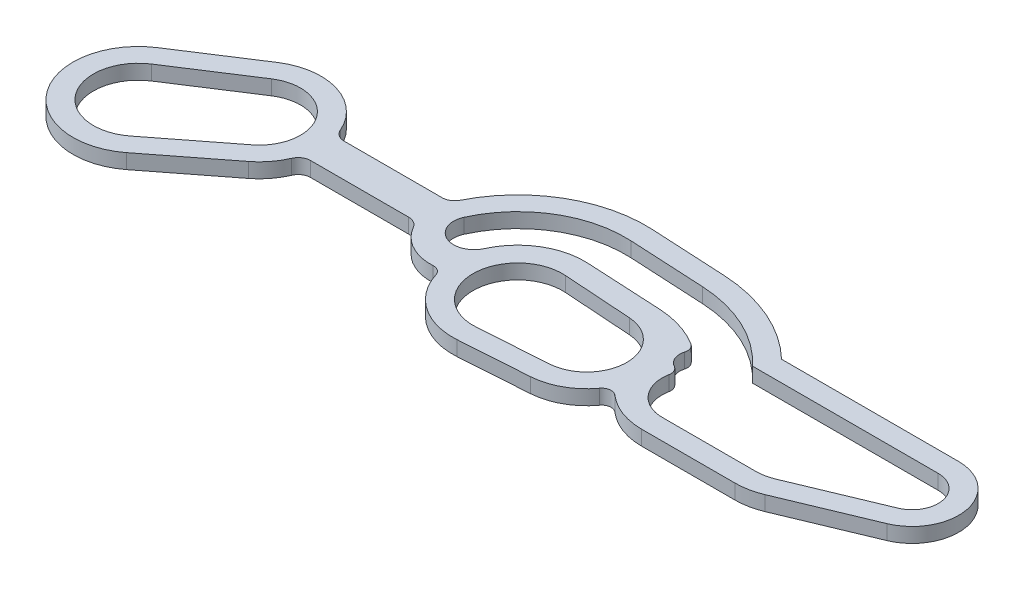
ISO-10303-21;
HEADER;
FILE_DESCRIPTION(('STEP AP214'),'2;1');
FILE_NAME('part.step','',(''),(''),'','','');
FILE_SCHEMA(('AUTOMOTIVE_DESIGN { 1 0 10303 214 1 1 1 1 }'));
ENDSEC;
DATA;
#1=APPLICATION_CONTEXT('core data for automotive mechanical design processes');
#2=APPLICATION_PROTOCOL_DEFINITION('international standard','automotive_design',2000,#1);
#3=PRODUCT_CONTEXT('',#1,'mechanical');
#4=PRODUCT('Part','Part','',(#3));
#5=PRODUCT_RELATED_PRODUCT_CATEGORY('part','',(#4));
#6=PRODUCT_DEFINITION_FORMATION('','',#4);
#7=PRODUCT_DEFINITION_CONTEXT('part definition',#1,'design');
#8=PRODUCT_DEFINITION('design','',#6,#7);
#9=PRODUCT_DEFINITION_SHAPE('','',#8);
#10=(LENGTH_UNIT() NAMED_UNIT(*) SI_UNIT(.MILLI.,.METRE.));
#11=(NAMED_UNIT(*) PLANE_ANGLE_UNIT() SI_UNIT($,.RADIAN.));
#12=(NAMED_UNIT(*) SI_UNIT($,.STERADIAN.) SOLID_ANGLE_UNIT());
#13=UNCERTAINTY_MEASURE_WITH_UNIT(LENGTH_MEASURE(1.E-05),#10,'distance_accuracy_value','');
#14=(GEOMETRIC_REPRESENTATION_CONTEXT(3) GLOBAL_UNCERTAINTY_ASSIGNED_CONTEXT((#13)) GLOBAL_UNIT_ASSIGNED_CONTEXT((#10,
#11,#12)) REPRESENTATION_CONTEXT('',''));
#15=CARTESIAN_POINT('',(0.,0.,0.));
#16=DIRECTION('',(0.,0.,1.));
#17=DIRECTION('',(1.,0.,0.));
#18=AXIS2_PLACEMENT_3D('',#15,#16,#17);
#19=CARTESIAN_POINT('',(32.6356706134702,-51.96,3.60199531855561));
#20=DIRECTION('',(0.,-1.,0.));
#21=DIRECTION('',(0.,0.,-1.));
#22=AXIS2_PLACEMENT_3D('',#19,#20,#21);
#23=CYLINDRICAL_SURFACE('',#22,8.46208096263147);
#24=CARTESIAN_POINT('',(32.6356706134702,-52.75,3.60199531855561));
#25=DIRECTION('',(0.,-1.,0.));
#26=DIRECTION('',(0.,0.,-1.));
#27=AXIS2_PLACEMENT_3D('',#24,#25,#26);
#28=CIRCLE('',#27,8.46208096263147);
#29=CARTESIAN_POINT('',(33.0785417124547,-52.75,-4.8484886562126));
#30=VERTEX_POINT('',#29);
#31=CARTESIAN_POINT('',(38.4984743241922,-52.75,-2.5));
#32=VERTEX_POINT('',#31);
#33=EDGE_CURVE('E522',#30,#32,#28,.T.);
#34=ORIENTED_EDGE('',*,*,#33,.F.);
#35=DIRECTION('',(0.,-1.,0.));
#36=VECTOR('',#35,1.);
#37=CARTESIAN_POINT('',(33.0785417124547,-51.96,-4.8484886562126));
#38=LINE('',#37,#36);
#39=CARTESIAN_POINT('',(33.0785417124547,-51.96,-4.8484886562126));
#40=VERTEX_POINT('',#39);
#41=EDGE_CURVE('E11',#40,#30,#38,.T.);
#42=ORIENTED_EDGE('',*,*,#41,.F.);
#43=CARTESIAN_POINT('',(32.6356706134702,-51.96,3.60199531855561));
#44=DIRECTION('',(0.,-1.,0.));
#45=DIRECTION('',(0.,0.,-1.));
#46=AXIS2_PLACEMENT_3D('',#43,#44,#45);
#47=CIRCLE('',#46,8.46208096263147);
#48=CARTESIAN_POINT('',(38.4984743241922,-51.96,-2.5));
#49=VERTEX_POINT('',#48);
#50=EDGE_CURVE('E553',#40,#49,#47,.T.);
#51=ORIENTED_EDGE('',*,*,#50,.T.);
#52=DIRECTION('',(0.,-1.,0.));
#53=VECTOR('',#52,1.);
#54=CARTESIAN_POINT('',(38.4984743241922,-51.96,-2.5));
#55=LINE('',#54,#53);
#56=EDGE_CURVE('E42',#49,#32,#55,.T.);
#57=ORIENTED_EDGE('',*,*,#56,.T.);
#58=EDGE_LOOP('',(#34,#42,#51,#57));
#59=FACE_BOUND('',#58,.T.);
#60=ADVANCED_FACE('F39',(#59),#23,.T.);
#61=CARTESIAN_POINT('',(29.0096081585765,-51.96,-5.06173242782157));
#62=DIRECTION('',(0.0523359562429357,0.,-0.998629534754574));
#63=DIRECTION('',(-0.998629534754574,0.,-0.0523359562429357));
#64=AXIS2_PLACEMENT_3D('',#61,#62,#63);
#65=PLANE('',#64);
#66=DIRECTION('',(0.998629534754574,0.,0.0523359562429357));
#67=VECTOR('',#66,1.);
#68=CARTESIAN_POINT('',(29.0096081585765,-52.75,-5.06173242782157));
#69=LINE('',#68,#67);
#70=CARTESIAN_POINT('',(29.0096081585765,-52.75,-5.06173242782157));
#71=VERTEX_POINT('',#70);
#72=EDGE_CURVE('E557',#71,#30,#69,.T.);
#73=ORIENTED_EDGE('',*,*,#72,.F.);
#74=DIRECTION('',(0.,-1.,0.));
#75=VECTOR('',#74,1.);
#76=CARTESIAN_POINT('',(29.0096081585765,-51.96,-5.06173242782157));
#77=LINE('',#76,#75);
#78=CARTESIAN_POINT('',(29.0096081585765,-51.96,-5.06173242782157));
#79=VERTEX_POINT('',#78);
#80=EDGE_CURVE('E47',#79,#71,#77,.T.);
#81=ORIENTED_EDGE('',*,*,#80,.F.);
#82=DIRECTION('',(0.998629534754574,0.,0.0523359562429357));
#83=VECTOR('',#82,1.);
#84=CARTESIAN_POINT('',(29.0096081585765,-51.96,-5.06173242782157));
#85=LINE('',#84,#83);
#86=EDGE_CURVE('E629',#79,#40,#85,.T.);
#87=ORIENTED_EDGE('',*,*,#86,.T.);
#88=ORIENTED_EDGE('',*,*,#41,.T.);
#89=EDGE_LOOP('',(#73,#81,#87,#88));
#90=FACE_BOUND('',#89,.T.);
#91=ADVANCED_FACE('F766',(#90),#65,.T.);
#92=CARTESIAN_POINT('',(28.65,-51.96,1.8));
#93=DIRECTION('',(0.,-1.,0.));
#94=DIRECTION('',(0.,0.,-1.));
#95=AXIS2_PLACEMENT_3D('',#92,#93,#94);
#96=CYLINDRICAL_SURFACE('',#95,6.8711490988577);
#97=CARTESIAN_POINT('',(28.65,-52.75,1.8));
#98=DIRECTION('',(0.,-1.,0.));
#99=DIRECTION('',(0.,0.,-1.));
#100=AXIS2_PLACEMENT_3D('',#97,#98,#99);
#101=CIRCLE('',#100,6.8711490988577);
#102=CARTESIAN_POINT('',(22.5059000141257,-52.75,-1.27615430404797));
#103=VERTEX_POINT('',#102);
#104=EDGE_CURVE('E703',#103,#71,#101,.T.);
#105=ORIENTED_EDGE('',*,*,#104,.F.);
#106=DIRECTION('',(0.,-1.,0.));
#107=VECTOR('',#106,1.);
#108=CARTESIAN_POINT('',(22.5059000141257,-51.96,-1.27615430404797));
#109=LINE('',#108,#107);
#110=CARTESIAN_POINT('',(22.5059000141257,-51.96,-1.27615430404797));
#111=VERTEX_POINT('',#110);
#112=EDGE_CURVE('E709',#111,#103,#109,.T.);
#113=ORIENTED_EDGE('',*,*,#112,.F.);
#114=CARTESIAN_POINT('',(28.65,-51.96,1.8));
#115=DIRECTION('',(0.,-1.,0.));
#116=DIRECTION('',(0.,0.,-1.));
#117=AXIS2_PLACEMENT_3D('',#114,#115,#116);
#118=CIRCLE('',#117,6.8711490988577);
#119=EDGE_CURVE('E626',#111,#79,#118,.T.);
#120=ORIENTED_EDGE('',*,*,#119,.T.);
#121=ORIENTED_EDGE('',*,*,#80,.T.);
#122=EDGE_LOOP('',(#105,#113,#120,#121));
#123=FACE_BOUND('',#122,.T.);
#124=ADVANCED_FACE('F858',(#123),#96,.T.);
#125=CARTESIAN_POINT('',(21.8969058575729,-51.96,-1.58105819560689));
#126=DIRECTION('',(0.,-1.,0.));
#127=DIRECTION('',(0.,0.,-1.));
#128=AXIS2_PLACEMENT_3D('',#125,#126,#127);
#129=CYLINDRICAL_SURFACE('',#128,0.681058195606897);
#130=CARTESIAN_POINT('',(21.8969058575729,-52.75,-1.58105819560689));
#131=DIRECTION('',(0.,1.,0.));
#132=DIRECTION('',(0.,0.,-1.));
#133=AXIS2_PLACEMENT_3D('',#130,#131,#132);
#134=CIRCLE('',#133,0.681058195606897);
#135=CARTESIAN_POINT('',(21.8969058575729,-52.75,-0.899999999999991));
#136=VERTEX_POINT('',#135);
#137=EDGE_CURVE('E700',#136,#103,#134,.T.);
#138=ORIENTED_EDGE('',*,*,#137,.F.);
#139=DIRECTION('',(0.,-1.,0.));
#140=VECTOR('',#139,1.);
#141=CARTESIAN_POINT('',(21.8969058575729,-51.96,-0.899999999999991));
#142=LINE('',#141,#140);
#143=CARTESIAN_POINT('',(21.8969058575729,-51.96,-0.899999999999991));
#144=VERTEX_POINT('',#143);
#145=EDGE_CURVE('E711',#144,#136,#142,.T.);
#146=ORIENTED_EDGE('',*,*,#145,.F.);
#147=CARTESIAN_POINT('',(21.8969058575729,-51.96,-1.58105819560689));
#148=DIRECTION('',(0.,1.,0.));
#149=DIRECTION('',(0.,0.,-1.));
#150=AXIS2_PLACEMENT_3D('',#147,#148,#149);
#151=CIRCLE('',#150,0.681058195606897);
#152=EDGE_CURVE('E623',#144,#111,#151,.T.);
#153=ORIENTED_EDGE('',*,*,#152,.T.);
#154=ORIENTED_EDGE('',*,*,#112,.T.);
#155=EDGE_LOOP('',(#138,#146,#153,#154));
#156=FACE_BOUND('',#155,.T.);
#157=ADVANCED_FACE('F856',(#156),#129,.F.);
#158=CARTESIAN_POINT('',(16.6432188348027,-51.96,-0.900000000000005));
#159=DIRECTION('',(0.,0.,-1.));
#160=DIRECTION('',(-1.,0.,0.));
#161=AXIS2_PLACEMENT_3D('',#158,#159,#160);
#162=PLANE('',#161);
#163=DIRECTION('',(1.,0.,0.));
#164=VECTOR('',#163,1.);
#165=CARTESIAN_POINT('',(16.6432188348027,-52.75,-0.900000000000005));
#166=LINE('',#165,#164);
#167=CARTESIAN_POINT('',(16.6432188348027,-52.75,-0.9));
#168=VERTEX_POINT('',#167);
#169=EDGE_CURVE('E697',#168,#136,#166,.T.);
#170=ORIENTED_EDGE('',*,*,#169,.F.);
#171=DIRECTION('',(0.,-1.,0.));
#172=VECTOR('',#171,1.);
#173=CARTESIAN_POINT('',(16.6432188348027,-51.96,-0.9));
#174=LINE('',#173,#172);
#175=CARTESIAN_POINT('',(16.6432188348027,-51.96,-0.9));
#176=VERTEX_POINT('',#175);
#177=EDGE_CURVE('E713',#176,#168,#174,.T.);
#178=ORIENTED_EDGE('',*,*,#177,.F.);
#179=DIRECTION('',(1.,0.,0.));
#180=VECTOR('',#179,1.);
#181=CARTESIAN_POINT('',(16.6432188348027,-51.96,-0.900000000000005));
#182=LINE('',#181,#180);
#183=EDGE_CURVE('E620',#176,#144,#182,.T.);
#184=ORIENTED_EDGE('',*,*,#183,.T.);
#185=ORIENTED_EDGE('',*,*,#145,.T.);
#186=EDGE_LOOP('',(#170,#178,#184,#185));
#187=FACE_BOUND('',#186,.T.);
#188=ADVANCED_FACE('F852',(#187),#162,.T.);
#189=CARTESIAN_POINT('',(16.6432188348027,-51.96,-1.56521739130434));
#190=DIRECTION('',(0.,-1.,0.));
#191=DIRECTION('',(0.,0.,-1.));
#192=AXIS2_PLACEMENT_3D('',#189,#190,#191);
#193=CYLINDRICAL_SURFACE('',#192,0.665217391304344);
#194=CARTESIAN_POINT('',(16.6432188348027,-52.75,-1.56521739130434));
#195=DIRECTION('',(0.,1.,0.));
#196=DIRECTION('',(0.,0.,1.));
#197=AXIS2_PLACEMENT_3D('',#194,#195,#196);
#198=CIRCLE('',#197,0.665217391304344);
#199=CARTESIAN_POINT('',(16.0320209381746,-52.75,-1.30263157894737));
#200=VERTEX_POINT('',#199);
#201=EDGE_CURVE('E694',#200,#168,#198,.T.);
#202=ORIENTED_EDGE('',*,*,#201,.F.);
#203=DIRECTION('',(0.,-1.,0.));
#204=VECTOR('',#203,1.);
#205=CARTESIAN_POINT('',(16.0320209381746,-51.96,-1.30263157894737));
#206=LINE('',#205,#204);
#207=CARTESIAN_POINT('',(16.0320209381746,-51.96,-1.30263157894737));
#208=VERTEX_POINT('',#207);
#209=EDGE_CURVE('E715',#208,#200,#206,.T.);
#210=ORIENTED_EDGE('',*,*,#209,.F.);
#211=CARTESIAN_POINT('',(16.6432188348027,-51.96,-1.56521739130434));
#212=DIRECTION('',(0.,1.,0.));
#213=DIRECTION('',(0.,0.,1.));
#214=AXIS2_PLACEMENT_3D('',#211,#212,#213);
#215=CIRCLE('',#214,0.665217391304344);
#216=EDGE_CURVE('E617',#208,#176,#215,.T.);
#217=ORIENTED_EDGE('',*,*,#216,.T.);
#218=ORIENTED_EDGE('',*,*,#177,.T.);
#219=EDGE_LOOP('',(#202,#210,#217,#218));
#220=FACE_BOUND('',#219,.T.);
#221=ADVANCED_FACE('F848',(#220),#193,.F.);
#222=CARTESIAN_POINT('',(13.,-51.96,0.));
#223=DIRECTION('',(0.,-1.,0.));
#224=DIRECTION('',(0.,0.,-1.));
#225=AXIS2_PLACEMENT_3D('',#222,#223,#224);
#226=CYLINDRICAL_SURFACE('',#225,3.3);
#227=CARTESIAN_POINT('',(13.,-52.75,0.));
#228=DIRECTION('',(0.,-1.,0.));
#229=DIRECTION('',(0.,0.,-1.));
#230=AXIS2_PLACEMENT_3D('',#227,#228,#229);
#231=CIRCLE('',#230,3.3);
#232=CARTESIAN_POINT('',(11.2057929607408,-52.75,-2.7696247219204));
#233=VERTEX_POINT('',#232);
#234=EDGE_CURVE('E691',#233,#200,#231,.T.);
#235=ORIENTED_EDGE('',*,*,#234,.F.);
#236=DIRECTION('',(0.,-1.,0.));
#237=VECTOR('',#236,1.);
#238=CARTESIAN_POINT('',(11.2057929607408,-51.96,-2.7696247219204));
#239=LINE('',#238,#237);
#240=CARTESIAN_POINT('',(11.2057929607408,-51.96,-2.7696247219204));
#241=VERTEX_POINT('',#240);
#242=EDGE_CURVE('E717',#241,#233,#239,.T.);
#243=ORIENTED_EDGE('',*,*,#242,.F.);
#244=CARTESIAN_POINT('',(13.,-51.96,0.));
#245=DIRECTION('',(0.,-1.,0.));
#246=DIRECTION('',(0.,0.,-1.));
#247=AXIS2_PLACEMENT_3D('',#244,#245,#246);
#248=CIRCLE('',#247,3.3);
#249=EDGE_CURVE('E614',#241,#208,#248,.T.);
#250=ORIENTED_EDGE('',*,*,#249,.T.);
#251=ORIENTED_EDGE('',*,*,#209,.T.);
#252=EDGE_LOOP('',(#235,#243,#250,#251));
#253=FACE_BOUND('',#252,.T.);
#254=ADVANCED_FACE('F844',(#253),#226,.T.);
#255=CARTESIAN_POINT('',(7.29705314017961,-51.96,-0.237480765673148));
#256=DIRECTION('',(-0.543699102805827,0.,-0.839280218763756));
#257=DIRECTION('',(-0.839280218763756,0.,0.543699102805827));
#258=AXIS2_PLACEMENT_3D('',#255,#256,#257);
#259=PLANE('',#258);
#260=DIRECTION('',(0.839280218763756,0.,-0.543699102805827));
#261=VECTOR('',#260,1.);
#262=CARTESIAN_POINT('',(7.29705314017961,-52.75,-0.237480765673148));
#263=LINE('',#262,#261);
#264=CARTESIAN_POINT('',(7.29705314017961,-52.75,-0.237480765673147));
#265=VERTEX_POINT('',#264);
#266=EDGE_CURVE('E688',#265,#233,#263,.T.);
#267=ORIENTED_EDGE('',*,*,#266,.F.);
#268=DIRECTION('',(0.,-1.,0.));
#269=VECTOR('',#268,1.);
#270=CARTESIAN_POINT('',(7.29705314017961,-51.96,-0.237480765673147));
#271=LINE('',#270,#269);
#272=CARTESIAN_POINT('',(7.29705314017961,-51.96,-0.237480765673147));
#273=VERTEX_POINT('',#272);
#274=EDGE_CURVE('E719',#273,#265,#271,.T.);
#275=ORIENTED_EDGE('',*,*,#274,.F.);
#276=DIRECTION('',(0.839280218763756,0.,-0.543699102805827));
#277=VECTOR('',#276,1.);
#278=CARTESIAN_POINT('',(7.29705314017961,-51.96,-0.237480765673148));
#279=LINE('',#278,#277);
#280=EDGE_CURVE('E611',#273,#241,#279,.T.);
#281=ORIENTED_EDGE('',*,*,#280,.T.);
#282=ORIENTED_EDGE('',*,*,#242,.T.);
#283=EDGE_LOOP('',(#267,#275,#281,#282));
#284=FACE_BOUND('',#283,.T.);
#285=ADVANCED_FACE('F840',(#284),#259,.T.);
#286=CARTESIAN_POINT('',(9.2,-51.96,2.7));
#287=DIRECTION('',(0.,-1.,0.));
#288=DIRECTION('',(0.,0.,-1.));
#289=AXIS2_PLACEMENT_3D('',#286,#287,#288);
#290=CYLINDRICAL_SURFACE('',#289,3.5);
#291=CARTESIAN_POINT('',(9.2,-52.75,2.7));
#292=DIRECTION('',(0.,-1.,0.));
#293=DIRECTION('',(0.,0.,-1.));
#294=AXIS2_PLACEMENT_3D('',#291,#292,#293);
#295=CIRCLE('',#294,3.5);
#296=CARTESIAN_POINT('',(11.3477696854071,-52.75,5.46352770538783));
#297=VERTEX_POINT('',#296);
#298=EDGE_CURVE('E685',#297,#265,#295,.T.);
#299=ORIENTED_EDGE('',*,*,#298,.F.);
#300=DIRECTION('',(0.,-1.,0.));
#301=VECTOR('',#300,1.);
#302=CARTESIAN_POINT('',(11.3477696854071,-51.96,5.46352770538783));
#303=LINE('',#302,#301);
#304=CARTESIAN_POINT('',(11.3477696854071,-51.96,5.46352770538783));
#305=VERTEX_POINT('',#304);
#306=EDGE_CURVE('E721',#305,#297,#303,.T.);
#307=ORIENTED_EDGE('',*,*,#306,.F.);
#308=CARTESIAN_POINT('',(9.2,-51.96,2.7));
#309=DIRECTION('',(0.,-1.,0.));
#310=DIRECTION('',(0.,0.,-1.));
#311=AXIS2_PLACEMENT_3D('',#308,#309,#310);
#312=CIRCLE('',#311,3.5);
#313=EDGE_CURVE('E608',#305,#273,#312,.T.);
#314=ORIENTED_EDGE('',*,*,#313,.T.);
#315=ORIENTED_EDGE('',*,*,#274,.T.);
#316=EDGE_LOOP('',(#299,#307,#314,#315));
#317=FACE_BOUND('',#316,.T.);
#318=ADVANCED_FACE('F836',(#317),#290,.T.);
#319=CARTESIAN_POINT('',(15.0250399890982,-51.96,2.60561183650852));
#320=DIRECTION('',(0.613648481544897,0.,0.789579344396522));
#321=DIRECTION('',(0.789579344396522,0.,-0.613648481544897));
#322=AXIS2_PLACEMENT_3D('',#319,#320,#321);
#323=PLANE('',#322);
#324=DIRECTION('',(-0.789579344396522,0.,0.613648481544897));
#325=VECTOR('',#324,1.);
#326=CARTESIAN_POINT('',(15.0250399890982,-52.75,2.60561183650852));
#327=LINE('',#326,#325);
#328=CARTESIAN_POINT('',(15.0250399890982,-52.75,2.60561183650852));
#329=VERTEX_POINT('',#328);
#330=EDGE_CURVE('E682',#329,#297,#327,.T.);
#331=ORIENTED_EDGE('',*,*,#330,.F.);
#332=DIRECTION('',(0.,-1.,0.));
#333=VECTOR('',#332,1.);
#334=CARTESIAN_POINT('',(15.0250399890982,-51.96,2.60561183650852));
#335=LINE('',#334,#333);
#336=CARTESIAN_POINT('',(15.0250399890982,-51.96,2.60561183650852));
#337=VERTEX_POINT('',#336);
#338=EDGE_CURVE('E723',#337,#329,#335,.T.);
#339=ORIENTED_EDGE('',*,*,#338,.F.);
#340=DIRECTION('',(-0.789579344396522,0.,0.613648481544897));
#341=VECTOR('',#340,1.);
#342=CARTESIAN_POINT('',(15.0250399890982,-51.96,2.60561183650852));
#343=LINE('',#342,#341);
#344=EDGE_CURVE('E605',#337,#305,#343,.T.);
#345=ORIENTED_EDGE('',*,*,#344,.T.);
#346=ORIENTED_EDGE('',*,*,#306,.T.);
#347=EDGE_LOOP('',(#331,#339,#345,#346));
#348=FACE_BOUND('',#347,.T.);
#349=ADVANCED_FACE('F832',(#348),#323,.T.);
#350=CARTESIAN_POINT('',(13.,-51.96,0.));
#351=DIRECTION('',(0.,-1.,0.));
#352=DIRECTION('',(0.,0.,-1.));
#353=AXIS2_PLACEMENT_3D('',#350,#351,#352);
#354=CYLINDRICAL_SURFACE('',#353,3.3);
#355=CARTESIAN_POINT('',(13.,-52.75,0.));
#356=DIRECTION('',(0.,-1.,0.));
#357=DIRECTION('',(0.,0.,-1.));
#358=AXIS2_PLACEMENT_3D('',#355,#356,#357);
#359=CIRCLE('',#358,3.3);
#360=CARTESIAN_POINT('',(16.0320209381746,-52.75,1.30263157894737));
#361=VERTEX_POINT('',#360);
#362=EDGE_CURVE('E679',#361,#329,#359,.T.);
#363=ORIENTED_EDGE('',*,*,#362,.F.);
#364=DIRECTION('',(0.,-1.,0.));
#365=VECTOR('',#364,1.);
#366=CARTESIAN_POINT('',(16.0320209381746,-51.96,1.30263157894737));
#367=LINE('',#366,#365);
#368=CARTESIAN_POINT('',(16.0320209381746,-51.96,1.30263157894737));
#369=VERTEX_POINT('',#368);
#370=EDGE_CURVE('E725',#369,#361,#367,.T.);
#371=ORIENTED_EDGE('',*,*,#370,.F.);
#372=CARTESIAN_POINT('',(13.,-51.96,0.));
#373=DIRECTION('',(0.,-1.,0.));
#374=DIRECTION('',(0.,0.,-1.));
#375=AXIS2_PLACEMENT_3D('',#372,#373,#374);
#376=CIRCLE('',#375,3.3);
#377=EDGE_CURVE('E602',#369,#337,#376,.T.);
#378=ORIENTED_EDGE('',*,*,#377,.T.);
#379=ORIENTED_EDGE('',*,*,#338,.T.);
#380=EDGE_LOOP('',(#363,#371,#378,#379));
#381=FACE_BOUND('',#380,.T.);
#382=ADVANCED_FACE('F828',(#381),#354,.T.);
#383=CARTESIAN_POINT('',(16.6432188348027,-51.96,1.56521739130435));
#384=DIRECTION('',(0.,-1.,0.));
#385=DIRECTION('',(0.,0.,-1.));
#386=AXIS2_PLACEMENT_3D('',#383,#384,#385);
#387=CYLINDRICAL_SURFACE('',#386,0.665217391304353);
#388=CARTESIAN_POINT('',(16.6432188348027,-52.75,1.56521739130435));
#389=DIRECTION('',(0.,1.,0.));
#390=DIRECTION('',(0.,0.,1.));
#391=AXIS2_PLACEMENT_3D('',#388,#389,#390);
#392=CIRCLE('',#391,0.665217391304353);
#393=CARTESIAN_POINT('',(16.6432188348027,-52.75,0.899999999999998));
#394=VERTEX_POINT('',#393);
#395=EDGE_CURVE('E676',#394,#361,#392,.T.);
#396=ORIENTED_EDGE('',*,*,#395,.F.);
#397=DIRECTION('',(0.,-1.,0.));
#398=VECTOR('',#397,1.);
#399=CARTESIAN_POINT('',(16.6432188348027,-51.96,0.899999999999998));
#400=LINE('',#399,#398);
#401=CARTESIAN_POINT('',(16.6432188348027,-51.96,0.899999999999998));
#402=VERTEX_POINT('',#401);
#403=EDGE_CURVE('E727',#402,#394,#400,.T.);
#404=ORIENTED_EDGE('',*,*,#403,.F.);
#405=CARTESIAN_POINT('',(16.6432188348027,-51.96,1.56521739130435));
#406=DIRECTION('',(0.,1.,0.));
#407=DIRECTION('',(0.,0.,1.));
#408=AXIS2_PLACEMENT_3D('',#405,#406,#407);
#409=CIRCLE('',#408,0.665217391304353);
#410=EDGE_CURVE('E599',#402,#369,#409,.T.);
#411=ORIENTED_EDGE('',*,*,#410,.T.);
#412=ORIENTED_EDGE('',*,*,#370,.T.);
#413=EDGE_LOOP('',(#396,#404,#411,#412));
#414=FACE_BOUND('',#413,.T.);
#415=ADVANCED_FACE('F824',(#414),#387,.F.);
#416=CARTESIAN_POINT('',(16.6432188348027,-51.96,0.899999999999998));
#417=DIRECTION('',(0.,0.,1.));
#418=DIRECTION('',(1.,0.,0.));
#419=AXIS2_PLACEMENT_3D('',#416,#417,#418);
#420=PLANE('',#419);
#421=DIRECTION('',(-1.,0.,0.));
#422=VECTOR('',#421,1.);
#423=CARTESIAN_POINT('',(16.6432188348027,-52.75,0.899999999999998));
#424=LINE('',#423,#422);
#425=CARTESIAN_POINT('',(21.8953853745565,-52.75,0.899999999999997));
#426=VERTEX_POINT('',#425);
#427=EDGE_CURVE('E673',#426,#394,#424,.T.);
#428=ORIENTED_EDGE('',*,*,#427,.F.);
#429=DIRECTION('',(0.,-1.,0.));
#430=VECTOR('',#429,1.);
#431=CARTESIAN_POINT('',(21.8953853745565,-51.96,0.899999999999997));
#432=LINE('',#431,#430);
#433=CARTESIAN_POINT('',(21.8953853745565,-51.96,0.899999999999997));
#434=VERTEX_POINT('',#433);
#435=EDGE_CURVE('E729',#434,#426,#432,.T.);
#436=ORIENTED_EDGE('',*,*,#435,.F.);
#437=DIRECTION('',(-1.,0.,0.));
#438=VECTOR('',#437,1.);
#439=CARTESIAN_POINT('',(16.6432188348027,-51.96,0.899999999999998));
#440=LINE('',#439,#438);
#441=EDGE_CURVE('E596',#434,#402,#440,.T.);
#442=ORIENTED_EDGE('',*,*,#441,.T.);
#443=ORIENTED_EDGE('',*,*,#403,.T.);
#444=EDGE_LOOP('',(#428,#436,#442,#443));
#445=FACE_BOUND('',#444,.T.);
#446=ADVANCED_FACE('F820',(#445),#420,.T.);
#447=CARTESIAN_POINT('',(21.8953853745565,-51.96,1.6));
#448=DIRECTION('',(0.,-1.,0.));
#449=DIRECTION('',(0.,0.,-1.));
#450=AXIS2_PLACEMENT_3D('',#447,#448,#449);
#451=CYLINDRICAL_SURFACE('',#450,0.700000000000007);
#452=CARTESIAN_POINT('',(21.8953853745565,-52.75,1.6));
#453=DIRECTION('',(0.,1.,0.));
#454=DIRECTION('',(0.,0.,1.));
#455=AXIS2_PLACEMENT_3D('',#452,#453,#454);
#456=CIRCLE('',#455,0.700000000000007);
#457=CARTESIAN_POINT('',(22.5016031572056,-52.75,1.25));
#458=VERTEX_POINT('',#457);
#459=EDGE_CURVE('E670',#458,#426,#456,.T.);
#460=ORIENTED_EDGE('',*,*,#459,.F.);
#461=DIRECTION('',(0.,-1.,0.));
#462=VECTOR('',#461,1.);
#463=CARTESIAN_POINT('',(22.5016031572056,-51.96,1.25));
#464=LINE('',#463,#462);
#465=CARTESIAN_POINT('',(22.5016031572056,-51.96,1.25));
#466=VERTEX_POINT('',#465);
#467=EDGE_CURVE('E731',#466,#458,#464,.T.);
#468=ORIENTED_EDGE('',*,*,#467,.F.);
#469=CARTESIAN_POINT('',(21.8953853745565,-51.96,1.6));
#470=DIRECTION('',(0.,1.,0.));
#471=DIRECTION('',(0.,0.,1.));
#472=AXIS2_PLACEMENT_3D('',#469,#470,#471);
#473=CIRCLE('',#472,0.700000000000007);
#474=EDGE_CURVE('E593',#466,#434,#473,.T.);
#475=ORIENTED_EDGE('',*,*,#474,.T.);
#476=ORIENTED_EDGE('',*,*,#435,.T.);
#477=EDGE_LOOP('',(#460,#468,#475,#476));
#478=FACE_BOUND('',#477,.T.);
#479=ADVANCED_FACE('F816',(#478),#451,.F.);
#480=CARTESIAN_POINT('',(24.6666666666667,-51.96,0.));
#481=DIRECTION('',(0.,-1.,0.));
#482=DIRECTION('',(0.,0.,-1.));
#483=AXIS2_PLACEMENT_3D('',#480,#481,#482);
#484=CYLINDRICAL_SURFACE('',#483,2.5);
#485=CARTESIAN_POINT('',(24.6666666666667,-52.75,0.));
#486=DIRECTION('',(0.,-1.,0.));
#487=DIRECTION('',(0.,0.,-1.));
#488=AXIS2_PLACEMENT_3D('',#485,#486,#487);
#489=CIRCLE('',#488,2.5);
#490=CARTESIAN_POINT('',(24.8051098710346,-52.75,2.49616375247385));
#491=VERTEX_POINT('',#490);
#492=EDGE_CURVE('E667',#491,#458,#489,.T.);
#493=ORIENTED_EDGE('',*,*,#492,.F.);
#494=DIRECTION('',(0.,-1.,0.));
#495=VECTOR('',#494,1.);
#496=CARTESIAN_POINT('',(24.8051098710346,-51.96,2.49616375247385));
#497=LINE('',#496,#495);
#498=CARTESIAN_POINT('',(24.8051098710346,-51.96,2.49616375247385));
#499=VERTEX_POINT('',#498);
#500=EDGE_CURVE('E733',#499,#491,#497,.T.);
#501=ORIENTED_EDGE('',*,*,#500,.F.);
#502=CARTESIAN_POINT('',(24.6666666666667,-51.96,0.));
#503=DIRECTION('',(0.,-1.,0.));
#504=DIRECTION('',(0.,0.,-1.));
#505=AXIS2_PLACEMENT_3D('',#502,#503,#504);
#506=CIRCLE('',#505,2.5);
#507=EDGE_CURVE('E590',#499,#466,#506,.T.);
#508=ORIENTED_EDGE('',*,*,#507,.T.);
#509=ORIENTED_EDGE('',*,*,#467,.T.);
#510=EDGE_LOOP('',(#493,#501,#508,#509));
#511=FACE_BOUND('',#510,.T.);
#512=ADVANCED_FACE('F812',(#511),#484,.T.);
#513=CARTESIAN_POINT('',(24.8327985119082,-51.96,2.99539650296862));
#514=DIRECTION('',(0.,-1.,0.));
#515=DIRECTION('',(0.,0.,-1.));
#516=AXIS2_PLACEMENT_3D('',#513,#514,#515);
#517=CYLINDRICAL_SURFACE('',#516,0.500000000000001);
#518=CARTESIAN_POINT('',(24.8327985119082,-52.75,2.99539650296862));
#519=DIRECTION('',(0.,1.,0.));
#520=DIRECTION('',(0.,0.,-1.));
#521=AXIS2_PLACEMENT_3D('',#518,#519,#520);
#522=CIRCLE('',#521,0.500000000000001);
#523=CARTESIAN_POINT('',(25.3099486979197,-52.75,2.84597194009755));
#524=VERTEX_POINT('',#523);
#525=EDGE_CURVE('E664',#524,#491,#522,.T.);
#526=ORIENTED_EDGE('',*,*,#525,.F.);
#527=DIRECTION('',(0.,-1.,0.));
#528=VECTOR('',#527,1.);
#529=CARTESIAN_POINT('',(25.3099486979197,-51.96,2.84597194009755));
#530=LINE('',#529,#528);
#531=CARTESIAN_POINT('',(25.3099486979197,-51.96,2.84597194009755));
#532=VERTEX_POINT('',#531);
#533=EDGE_CURVE('E735',#532,#524,#530,.T.);
#534=ORIENTED_EDGE('',*,*,#533,.F.);
#535=CARTESIAN_POINT('',(24.8327985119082,-51.96,2.99539650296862));
#536=DIRECTION('',(0.,1.,0.));
#537=DIRECTION('',(0.,0.,-1.));
#538=AXIS2_PLACEMENT_3D('',#535,#536,#537);
#539=CIRCLE('',#538,0.500000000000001);
#540=EDGE_CURVE('E587',#532,#499,#539,.T.);
#541=ORIENTED_EDGE('',*,*,#540,.T.);
#542=ORIENTED_EDGE('',*,*,#500,.T.);
#543=EDGE_LOOP('',(#526,#534,#541,#542));
#544=FACE_BOUND('',#543,.T.);
#545=ADVANCED_FACE('F808',(#544),#517,.F.);
#546=CARTESIAN_POINT('',(28.65,-51.96,1.8));
#547=DIRECTION('',(0.,-1.,0.));
#548=DIRECTION('',(0.,0.,-1.));
#549=AXIS2_PLACEMENT_3D('',#546,#547,#548);
#550=CYLINDRICAL_SURFACE('',#549,3.5);
#551=CARTESIAN_POINT('',(28.65,-52.75,1.8));
#552=DIRECTION('',(0.,-1.,0.));
#553=DIRECTION('',(0.,0.,-1.));
#554=AXIS2_PLACEMENT_3D('',#551,#552,#553);
#555=CIRCLE('',#554,3.5);
#556=CARTESIAN_POINT('',(28.8864864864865,-52.75,5.29200145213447));
#557=VERTEX_POINT('',#556);
#558=EDGE_CURVE('E661',#557,#524,#555,.T.);
#559=ORIENTED_EDGE('',*,*,#558,.F.);
#560=DIRECTION('',(0.,-1.,0.));
#561=VECTOR('',#560,1.);
#562=CARTESIAN_POINT('',(28.8864864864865,-51.96,5.29200145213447));
#563=LINE('',#562,#561);
#564=CARTESIAN_POINT('',(28.8864864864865,-51.96,5.29200145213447));
#565=VERTEX_POINT('',#564);
#566=EDGE_CURVE('E737',#565,#557,#563,.T.);
#567=ORIENTED_EDGE('',*,*,#566,.F.);
#568=CARTESIAN_POINT('',(28.65,-51.96,1.8));
#569=DIRECTION('',(0.,-1.,0.));
#570=DIRECTION('',(0.,0.,-1.));
#571=AXIS2_PLACEMENT_3D('',#568,#569,#570);
#572=CIRCLE('',#571,3.5);
#573=EDGE_CURVE('E584',#565,#532,#572,.T.);
#574=ORIENTED_EDGE('',*,*,#573,.T.);
#575=ORIENTED_EDGE('',*,*,#533,.T.);
#576=EDGE_LOOP('',(#559,#567,#574,#575));
#577=FACE_BOUND('',#576,.T.);
#578=ADVANCED_FACE('F804',(#577),#550,.T.);
#579=CARTESIAN_POINT('',(32.5695945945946,-51.96,5.04257277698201));
#580=DIRECTION('',(0.0675675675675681,0.,0.99771470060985));
#581=DIRECTION('',(0.99771470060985,0.,-0.0675675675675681));
#582=AXIS2_PLACEMENT_3D('',#579,#580,#581);
#583=PLANE('',#582);
#584=DIRECTION('',(-0.99771470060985,0.,0.0675675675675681));
#585=VECTOR('',#584,1.);
#586=CARTESIAN_POINT('',(32.5695945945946,-52.75,5.04257277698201));
#587=LINE('',#586,#585);
#588=CARTESIAN_POINT('',(32.5695945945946,-52.75,5.04257277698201));
#589=VERTEX_POINT('',#588);
#590=EDGE_CURVE('E658',#589,#557,#587,.T.);
#591=ORIENTED_EDGE('',*,*,#590,.F.);
#592=DIRECTION('',(0.,-1.,0.));
#593=VECTOR('',#592,1.);
#594=CARTESIAN_POINT('',(32.5695945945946,-51.96,5.04257277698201));
#595=LINE('',#594,#593);
#596=CARTESIAN_POINT('',(32.5695945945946,-51.96,5.04257277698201));
#597=VERTEX_POINT('',#596);
#598=EDGE_CURVE('E739',#597,#589,#595,.T.);
#599=ORIENTED_EDGE('',*,*,#598,.F.);
#600=DIRECTION('',(-0.99771470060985,0.,0.0675675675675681));
#601=VECTOR('',#600,1.);
#602=CARTESIAN_POINT('',(32.5695945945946,-51.96,5.04257277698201));
#603=LINE('',#602,#601);
#604=EDGE_CURVE('E581',#597,#565,#603,.T.);
#605=ORIENTED_EDGE('',*,*,#604,.T.);
#606=ORIENTED_EDGE('',*,*,#566,.T.);
#607=EDGE_LOOP('',(#591,#599,#605,#606));
#608=FACE_BOUND('',#607,.T.);
#609=ADVANCED_FACE('F800',(#608),#583,.T.);
#610=CARTESIAN_POINT('',(32.35,-51.96,1.8));
#611=DIRECTION('',(0.,-1.,0.));
#612=DIRECTION('',(0.,0.,-1.));
#613=AXIS2_PLACEMENT_3D('',#610,#611,#612);
#614=CYLINDRICAL_SURFACE('',#613,3.24999999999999);
#615=CARTESIAN_POINT('',(32.35,-52.75,1.8));
#616=DIRECTION('',(0.,-1.,0.));
#617=DIRECTION('',(0.,0.,-1.));
#618=AXIS2_PLACEMENT_3D('',#615,#616,#617);
#619=CIRCLE('',#618,3.24999999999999);
#620=CARTESIAN_POINT('',(34.9709300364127,-52.75,3.72177671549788));
#621=VERTEX_POINT('',#620);
#622=EDGE_CURVE('E655',#621,#589,#619,.T.);
#623=ORIENTED_EDGE('',*,*,#622,.F.);
#624=DIRECTION('',(0.,-1.,0.));
#625=VECTOR('',#624,1.);
#626=CARTESIAN_POINT('',(34.9709300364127,-51.96,3.72177671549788));
#627=LINE('',#626,#625);
#628=CARTESIAN_POINT('',(34.9709300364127,-51.96,3.72177671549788));
#629=VERTEX_POINT('',#628);
#630=EDGE_CURVE('E741',#629,#621,#627,.T.);
#631=ORIENTED_EDGE('',*,*,#630,.F.);
#632=CARTESIAN_POINT('',(32.35,-51.96,1.8));
#633=DIRECTION('',(0.,-1.,0.));
#634=DIRECTION('',(0.,0.,-1.));
#635=AXIS2_PLACEMENT_3D('',#632,#633,#634);
#636=CIRCLE('',#635,3.24999999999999);
#637=EDGE_CURVE('E578',#629,#597,#636,.T.);
#638=ORIENTED_EDGE('',*,*,#637,.T.);
#639=ORIENTED_EDGE('',*,*,#598,.T.);
#640=EDGE_LOOP('',(#623,#631,#638,#639));
#641=FACE_BOUND('',#640,.T.);
#642=ADVANCED_FACE('F796',(#641),#614,.T.);
#643=CARTESIAN_POINT('',(35.3741500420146,-51.96,4.01743467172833));
#644=DIRECTION('',(0.,-1.,0.));
#645=DIRECTION('',(0.,0.,-1.));
#646=AXIS2_PLACEMENT_3D('',#643,#644,#645);
#647=CYLINDRICAL_SURFACE('',#646,0.500000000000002);
#648=CARTESIAN_POINT('',(35.3741500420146,-52.75,4.01743467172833));
#649=DIRECTION('',(0.,1.,0.));
#650=DIRECTION('',(0.,0.,-1.));
#651=AXIS2_PLACEMENT_3D('',#648,#649,#650);
#652=CIRCLE('',#651,0.500000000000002);
#653=CARTESIAN_POINT('',(35.7023812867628,-52.75,3.64025533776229));
#654=VERTEX_POINT('',#653);
#655=EDGE_CURVE('E652',#654,#621,#652,.T.);
#656=ORIENTED_EDGE('',*,*,#655,.F.);
#657=DIRECTION('',(0.,-1.,0.));
#658=VECTOR('',#657,1.);
#659=CARTESIAN_POINT('',(35.7023812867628,-51.96,3.64025533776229));
#660=LINE('',#659,#658);
#661=CARTESIAN_POINT('',(35.7023812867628,-51.96,3.64025533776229));
#662=VERTEX_POINT('',#661);
#663=EDGE_CURVE('E743',#662,#654,#660,.T.);
#664=ORIENTED_EDGE('',*,*,#663,.F.);
#665=CARTESIAN_POINT('',(35.3741500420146,-51.96,4.01743467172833));
#666=DIRECTION('',(0.,1.,0.));
#667=DIRECTION('',(0.,0.,-1.));
#668=AXIS2_PLACEMENT_3D('',#665,#666,#667);
#669=CIRCLE('',#668,0.500000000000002);
#670=EDGE_CURVE('E575',#662,#629,#669,.T.);
#671=ORIENTED_EDGE('',*,*,#670,.T.);
#672=ORIENTED_EDGE('',*,*,#630,.T.);
#673=EDGE_LOOP('',(#656,#664,#671,#672));
#674=FACE_BOUND('',#673,.T.);
#675=ADVANCED_FACE('F792',(#674),#647,.F.);
#676=CARTESIAN_POINT('',(38.,-51.96,1.));
#677=DIRECTION('',(0.,-1.,0.));
#678=DIRECTION('',(0.,0.,-1.));
#679=AXIS2_PLACEMENT_3D('',#676,#677,#678);
#680=CYLINDRICAL_SURFACE('',#679,3.5);
#681=CARTESIAN_POINT('',(38.,-52.75,1.));
#682=DIRECTION('',(0.,-1.,0.));
#683=DIRECTION('',(0.,0.,-1.));
#684=AXIS2_PLACEMENT_3D('',#681,#682,#683);
#685=CIRCLE('',#684,3.5);
#686=CARTESIAN_POINT('',(38.,-52.75,4.5));
#687=VERTEX_POINT('',#686);
#688=EDGE_CURVE('E649',#687,#654,#685,.T.);
#689=ORIENTED_EDGE('',*,*,#688,.F.);
#690=DIRECTION('',(0.,-1.,0.));
#691=VECTOR('',#690,1.);
#692=CARTESIAN_POINT('',(38.,-51.96,4.5));
#693=LINE('',#692,#691);
#694=CARTESIAN_POINT('',(38.,-51.96,4.5));
#695=VERTEX_POINT('',#694);
#696=EDGE_CURVE('E745',#695,#687,#693,.T.);
#697=ORIENTED_EDGE('',*,*,#696,.F.);
#698=CARTESIAN_POINT('',(38.,-51.96,1.));
#699=DIRECTION('',(0.,-1.,0.));
#700=DIRECTION('',(0.,0.,-1.));
#701=AXIS2_PLACEMENT_3D('',#698,#699,#700);
#702=CIRCLE('',#701,3.5);
#703=EDGE_CURVE('E572',#695,#662,#702,.T.);
#704=ORIENTED_EDGE('',*,*,#703,.T.);
#705=ORIENTED_EDGE('',*,*,#663,.T.);
#706=EDGE_LOOP('',(#689,#697,#704,#705));
#707=FACE_BOUND('',#706,.T.);
#708=ADVANCED_FACE('F788',(#707),#680,.T.);
#709=CARTESIAN_POINT('',(43.,-51.96,4.5));
#710=DIRECTION('',(0.,0.,1.));
#711=DIRECTION('',(1.,0.,0.));
#712=AXIS2_PLACEMENT_3D('',#709,#710,#711);
#713=PLANE('',#712);
#714=DIRECTION('',(-1.,0.,0.));
#715=VECTOR('',#714,1.);
#716=CARTESIAN_POINT('',(43.,-52.75,4.5));
#717=LINE('',#716,#715);
#718=CARTESIAN_POINT('',(43.,-52.75,4.5));
#719=VERTEX_POINT('',#718);
#720=EDGE_CURVE('E646',#719,#687,#717,.T.);
#721=ORIENTED_EDGE('',*,*,#720,.F.);
#722=DIRECTION('',(0.,-1.,0.));
#723=VECTOR('',#722,1.);
#724=CARTESIAN_POINT('',(43.,-51.96,4.5));
#725=LINE('',#724,#723);
#726=CARTESIAN_POINT('',(43.,-51.96,4.5));
#727=VERTEX_POINT('',#726);
#728=EDGE_CURVE('E747',#727,#719,#725,.T.);
#729=ORIENTED_EDGE('',*,*,#728,.F.);
#730=DIRECTION('',(-1.,0.,0.));
#731=VECTOR('',#730,1.);
#732=CARTESIAN_POINT('',(43.,-51.96,4.5));
#733=LINE('',#732,#731);
#734=EDGE_CURVE('E569',#727,#695,#733,.T.);
#735=ORIENTED_EDGE('',*,*,#734,.T.);
#736=ORIENTED_EDGE('',*,*,#696,.T.);
#737=EDGE_LOOP('',(#721,#729,#735,#736));
#738=FACE_BOUND('',#737,.T.);
#739=ADVANCED_FACE('F784',(#738),#713,.T.);
#740=CARTESIAN_POINT('',(43.,-51.96,1.));
#741=DIRECTION('',(0.,-1.,0.));
#742=DIRECTION('',(0.,0.,-1.));
#743=AXIS2_PLACEMENT_3D('',#740,#741,#742);
#744=CYLINDRICAL_SURFACE('',#743,3.5);
#745=CARTESIAN_POINT('',(43.,-52.75,1.));
#746=DIRECTION('',(0.,-1.,0.));
#747=DIRECTION('',(0.,0.,-1.));
#748=AXIS2_PLACEMENT_3D('',#745,#746,#747);
#749=CIRCLE('',#748,3.5);
#750=CARTESIAN_POINT('',(44.3461538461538,-52.75,4.23076923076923));
#751=VERTEX_POINT('',#750);
#752=EDGE_CURVE('E643',#751,#719,#749,.T.);
#753=ORIENTED_EDGE('',*,*,#752,.F.);
#754=DIRECTION('',(0.,-1.,0.));
#755=VECTOR('',#754,1.);
#756=CARTESIAN_POINT('',(44.3461538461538,-51.96,4.23076923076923));
#757=LINE('',#756,#755);
#758=CARTESIAN_POINT('',(44.3461538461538,-51.96,4.23076923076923));
#759=VERTEX_POINT('',#758);
#760=EDGE_CURVE('E749',#759,#751,#757,.T.);
#761=ORIENTED_EDGE('',*,*,#760,.F.);
#762=CARTESIAN_POINT('',(43.,-51.96,1.));
#763=DIRECTION('',(0.,-1.,0.));
#764=DIRECTION('',(0.,0.,-1.));
#765=AXIS2_PLACEMENT_3D('',#762,#763,#764);
#766=CIRCLE('',#765,3.5);
#767=EDGE_CURVE('E566',#759,#727,#766,.T.);
#768=ORIENTED_EDGE('',*,*,#767,.T.);
#769=ORIENTED_EDGE('',*,*,#728,.T.);
#770=EDGE_LOOP('',(#753,#761,#768,#769));
#771=FACE_BOUND('',#770,.T.);
#772=ADVANCED_FACE('F780',(#771),#744,.T.);
#773=CARTESIAN_POINT('',(48.9615384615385,-51.96,2.30769230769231));
#774=DIRECTION('',(0.384615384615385,0.,0.923076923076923));
#775=DIRECTION('',(0.923076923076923,0.,-0.384615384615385));
#776=AXIS2_PLACEMENT_3D('',#773,#774,#775);
#777=PLANE('',#776);
#778=DIRECTION('',(-0.923076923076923,0.,0.384615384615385));
#779=VECTOR('',#778,1.);
#780=CARTESIAN_POINT('',(48.9615384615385,-52.75,2.30769230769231));
#781=LINE('',#780,#779);
#782=CARTESIAN_POINT('',(48.9615384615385,-52.75,2.30769230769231));
#783=VERTEX_POINT('',#782);
#784=EDGE_CURVE('E640',#783,#751,#781,.T.);
#785=ORIENTED_EDGE('',*,*,#784,.F.);
#786=DIRECTION('',(0.,-1.,0.));
#787=VECTOR('',#786,1.);
#788=CARTESIAN_POINT('',(48.9615384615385,-51.96,2.30769230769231));
#789=LINE('',#788,#787);
#790=CARTESIAN_POINT('',(48.9615384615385,-51.96,2.30769230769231));
#791=VERTEX_POINT('',#790);
#792=EDGE_CURVE('E751',#791,#783,#789,.T.);
#793=ORIENTED_EDGE('',*,*,#792,.F.);
#794=DIRECTION('',(-0.923076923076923,0.,0.384615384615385));
#795=VECTOR('',#794,1.);
#796=CARTESIAN_POINT('',(48.9615384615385,-51.96,2.30769230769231));
#797=LINE('',#796,#795);
#798=EDGE_CURVE('E563',#791,#759,#797,.T.);
#799=ORIENTED_EDGE('',*,*,#798,.T.);
#800=ORIENTED_EDGE('',*,*,#760,.T.);
#801=EDGE_LOOP('',(#785,#793,#799,#800));
#802=FACE_BOUND('',#801,.T.);
#803=ADVANCED_FACE('F778',(#802),#777,.T.);
#804=CARTESIAN_POINT('',(48.,-51.96,0.));
#805=DIRECTION('',(0.,-1.,0.));
#806=DIRECTION('',(0.,0.,-1.));
#807=AXIS2_PLACEMENT_3D('',#804,#805,#806);
#808=CYLINDRICAL_SURFACE('',#807,2.5);
#809=CARTESIAN_POINT('',(48.,-52.75,0.));
#810=DIRECTION('',(0.,-1.,0.));
#811=DIRECTION('',(0.,0.,-1.));
#812=AXIS2_PLACEMENT_3D('',#809,#810,#811);
#813=CIRCLE('',#812,2.5);
#814=CARTESIAN_POINT('',(48.,-52.75,-2.5));
#815=VERTEX_POINT('',#814);
#816=EDGE_CURVE('E637',#815,#783,#813,.T.);
#817=ORIENTED_EDGE('',*,*,#816,.F.);
#818=DIRECTION('',(0.,-1.,0.));
#819=VECTOR('',#818,1.);
#820=CARTESIAN_POINT('',(48.,-51.96,-2.5));
#821=LINE('',#820,#819);
#822=CARTESIAN_POINT('',(48.,-51.96,-2.5));
#823=VERTEX_POINT('',#822);
#824=EDGE_CURVE('E752',#823,#815,#821,.T.);
#825=ORIENTED_EDGE('',*,*,#824,.F.);
#826=CARTESIAN_POINT('',(48.,-51.96,0.));
#827=DIRECTION('',(0.,-1.,0.));
#828=DIRECTION('',(0.,0.,-1.));
#829=AXIS2_PLACEMENT_3D('',#826,#827,#828);
#830=CIRCLE('',#829,2.5);
#831=EDGE_CURVE('E560',#823,#791,#830,.T.);
#832=ORIENTED_EDGE('',*,*,#831,.T.);
#833=ORIENTED_EDGE('',*,*,#792,.T.);
#834=EDGE_LOOP('',(#817,#825,#832,#833));
#835=FACE_BOUND('',#834,.T.);
#836=ADVANCED_FACE('F774',(#835),#808,.T.);
#837=CARTESIAN_POINT('',(38.4984743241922,-51.96,-2.5));
#838=DIRECTION('',(0.,0.,-1.));
#839=DIRECTION('',(-1.,0.,0.));
#840=AXIS2_PLACEMENT_3D('',#837,#838,#839);
#841=PLANE('',#840);
#842=DIRECTION('',(1.,0.,0.));
#843=VECTOR('',#842,1.);
#844=CARTESIAN_POINT('',(38.4984743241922,-52.75,-2.5));
#845=LINE('',#844,#843);
#846=EDGE_CURVE('E634',#32,#815,#845,.T.);
#847=ORIENTED_EDGE('',*,*,#846,.F.);
#848=ORIENTED_EDGE('',*,*,#56,.F.);
#849=DIRECTION('',(1.,0.,0.));
#850=VECTOR('',#849,1.);
#851=CARTESIAN_POINT('',(38.4984743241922,-51.96,-2.5));
#852=LINE('',#851,#850);
#853=EDGE_CURVE('E556',#49,#823,#852,.T.);
#854=ORIENTED_EDGE('',*,*,#853,.T.);
#855=ORIENTED_EDGE('',*,*,#824,.T.);
#856=EDGE_LOOP('',(#847,#848,#854,#855));
#857=FACE_BOUND('',#856,.T.);
#858=ADVANCED_FACE('F760',(#857),#841,.T.);
#859=CARTESIAN_POINT('',(32.6356706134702,-51.96,3.60199531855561));
#860=DIRECTION('',(0.,-1.,0.));
#861=DIRECTION('',(0.,0.,-1.));
#862=AXIS2_PLACEMENT_3D('',#859,#860,#861);
#863=PLANE('',#862);
#864=DIRECTION('',(0.839280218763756,0.,-0.543699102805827));
#865=VECTOR('',#864,1.);
#866=CARTESIAN_POINT('',(7.89512215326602,-51.96,0.685727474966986));
#867=LINE('',#866,#865);
#868=CARTESIAN_POINT('',(7.89512215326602,-51.96,0.685727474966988));
#869=VERTEX_POINT('',#868);
#870=CARTESIAN_POINT('',(11.8038619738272,-51.96,-1.84641648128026));
#871=VERTEX_POINT('',#870);
#872=EDGE_CURVE('E364',#869,#871,#867,.T.);
#873=ORIENTED_EDGE('',*,*,#872,.T.);
#874=CARTESIAN_POINT('',(13.,-51.96,0.));
#875=DIRECTION('',(0.,-1.,0.));
#876=DIRECTION('',(0.,0.,-1.));
#877=AXIS2_PLACEMENT_3D('',#874,#875,#876);
#878=CIRCLE('',#877,2.2);
#879=CARTESIAN_POINT('',(14.3500266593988,-51.96,1.73707455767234));
#880=VERTEX_POINT('',#879);
#881=EDGE_CURVE('E358',#871,#880,#878,.T.);
#882=ORIENTED_EDGE('',*,*,#881,.T.);
#883=DIRECTION('',(-0.789579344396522,0.,0.613648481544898));
#884=VECTOR('',#883,1.);
#885=CARTESIAN_POINT('',(14.3500266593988,-51.96,1.73707455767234));
#886=LINE('',#885,#884);
#887=CARTESIAN_POINT('',(10.6727563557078,-51.96,4.59499042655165));
#888=VERTEX_POINT('',#887);
#889=EDGE_CURVE('E367',#880,#888,#886,.T.);
#890=ORIENTED_EDGE('',*,*,#889,.T.);
#891=CARTESIAN_POINT('',(9.2,-51.96,2.7));
#892=DIRECTION('',(0.,-1.,0.));
#893=DIRECTION('',(0.,0.,-1.));
#894=AXIS2_PLACEMENT_3D('',#891,#892,#893);
#895=CIRCLE('',#894,2.4);
#896=EDGE_CURVE('E55',#888,#869,#895,.T.);
#897=ORIENTED_EDGE('',*,*,#896,.T.);
#898=EDGE_LOOP('',(#873,#882,#890,#897));
#899=FACE_BOUND('',#898,.T.);
#900=DIRECTION('',(-0.99771470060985,0.,0.0675675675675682));
#901=VECTOR('',#900,1.);
#902=CARTESIAN_POINT('',(32.4952702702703,-51.96,3.94508660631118));
#903=LINE('',#902,#901);
#904=CARTESIAN_POINT('',(32.4952702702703,-51.96,3.94508660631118));
#905=VERTEX_POINT('',#904);
#906=CARTESIAN_POINT('',(28.8121621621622,-51.96,4.19451528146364));
#907=VERTEX_POINT('',#906);
#908=EDGE_CURVE('E403',#905,#907,#903,.T.);
#909=ORIENTED_EDGE('',*,*,#908,.T.);
#910=CARTESIAN_POINT('',(28.65,-51.96,1.8));
#911=DIRECTION('',(0.,-1.,0.));
#912=DIRECTION('',(0.,0.,-1.));
#913=AXIS2_PLACEMENT_3D('',#910,#911,#912);
#914=CIRCLE('',#913,2.4);
#915=CARTESIAN_POINT('',(28.8121621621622,-51.96,-0.594515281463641));
#916=VERTEX_POINT('',#915);
#917=EDGE_CURVE('E393',#907,#916,#914,.T.);
#918=ORIENTED_EDGE('',*,*,#917,.T.);
#919=DIRECTION('',(0.99771470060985,0.,0.0675675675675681));
#920=VECTOR('',#919,1.);
#921=CARTESIAN_POINT('',(28.8121621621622,-51.96,-0.594515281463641));
#922=LINE('',#921,#920);
#923=CARTESIAN_POINT('',(32.4952702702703,-51.96,-0.345086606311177));
#924=VERTEX_POINT('',#923);
#925=EDGE_CURVE('E396',#916,#924,#922,.T.);
#926=ORIENTED_EDGE('',*,*,#925,.T.);
#927=CARTESIAN_POINT('',(32.35,-51.96,1.8));
#928=DIRECTION('',(0.,-1.,0.));
#929=DIRECTION('',(0.,0.,-1.));
#930=AXIS2_PLACEMENT_3D('',#927,#928,#929);
#931=CIRCLE('',#930,2.15);
#932=EDGE_CURVE('E400',#924,#905,#931,.T.);
#933=ORIENTED_EDGE('',*,*,#932,.T.);
#934=EDGE_LOOP('',(#909,#918,#926,#933));
#935=FACE_BOUND('',#934,.T.);
#936=DIRECTION('',(0.998629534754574,0.,0.0523359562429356));
#937=VECTOR('',#936,1.);
#938=CARTESIAN_POINT('',(28.9520386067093,-51.96,-3.96323993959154));
#939=LINE('',#938,#937);
#940=CARTESIAN_POINT('',(28.9520386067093,-51.96,-3.96323993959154));
#941=VERTEX_POINT('',#940);
#942=CARTESIAN_POINT('',(33.0209721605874,-51.96,-3.74999616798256));
#943=VERTEX_POINT('',#942);
#944=EDGE_CURVE('E471',#941,#943,#939,.T.);
#945=ORIENTED_EDGE('',*,*,#944,.T.);
#946=CARTESIAN_POINT('',(32.6356706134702,-51.96,3.60199531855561));
#947=DIRECTION('',(0.,-1.,0.));
#948=DIRECTION('',(0.,0.,-1.));
#949=AXIS2_PLACEMENT_3D('',#946,#947,#948);
#950=CIRCLE('',#949,7.36208096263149);
#951=CARTESIAN_POINT('',(38.0375479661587,-51.96,-1.4));
#952=VERTEX_POINT('',#951);
#953=EDGE_CURVE('E425',#943,#952,#950,.T.);
#954=ORIENTED_EDGE('',*,*,#953,.T.);
#955=DIRECTION('',(1.,0.,0.));
#956=VECTOR('',#955,1.);
#957=CARTESIAN_POINT('',(38.0375479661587,-51.96,-1.4));
#958=LINE('',#957,#956);
#959=CARTESIAN_POINT('',(48.,-51.96,-1.40000000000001));
#960=VERTEX_POINT('',#959);
#961=EDGE_CURVE('E428',#952,#960,#958,.T.);
#962=ORIENTED_EDGE('',*,*,#961,.T.);
#963=CARTESIAN_POINT('',(48.,-51.96,0.));
#964=DIRECTION('',(0.,-1.,0.));
#965=DIRECTION('',(0.,0.,-1.));
#966=AXIS2_PLACEMENT_3D('',#963,#964,#965);
#967=CIRCLE('',#966,1.4);
#968=CARTESIAN_POINT('',(48.5384615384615,-51.96,1.2923076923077));
#969=VERTEX_POINT('',#968);
#970=EDGE_CURVE('E432',#960,#969,#967,.T.);
#971=ORIENTED_EDGE('',*,*,#970,.T.);
#972=DIRECTION('',(-0.923076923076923,0.,0.384615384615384));
#973=VECTOR('',#972,1.);
#974=CARTESIAN_POINT('',(48.5384615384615,-51.96,1.2923076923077));
#975=LINE('',#974,#973);
#976=CARTESIAN_POINT('',(43.9230769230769,-51.96,3.21538461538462));
#977=VERTEX_POINT('',#976);
#978=EDGE_CURVE('E435',#969,#977,#975,.T.);
#979=ORIENTED_EDGE('',*,*,#978,.T.);
#980=CARTESIAN_POINT('',(43.,-51.96,1.));
#981=DIRECTION('',(0.,-1.,0.));
#982=DIRECTION('',(0.,0.,-1.));
#983=AXIS2_PLACEMENT_3D('',#980,#981,#982);
#984=CIRCLE('',#983,2.4);
#985=CARTESIAN_POINT('',(43.,-51.96,3.4));
#986=VERTEX_POINT('',#985);
#987=EDGE_CURVE('E438',#977,#986,#984,.T.);
#988=ORIENTED_EDGE('',*,*,#987,.T.);
#989=DIRECTION('',(-1.,0.,0.));
#990=VECTOR('',#989,1.);
#991=CARTESIAN_POINT('',(43.,-51.96,3.4));
#992=LINE('',#991,#990);
#993=CARTESIAN_POINT('',(38.,-51.96,3.4));
#994=VERTEX_POINT('',#993);
#995=EDGE_CURVE('E441',#986,#994,#992,.T.);
#996=ORIENTED_EDGE('',*,*,#995,.T.);
#997=CARTESIAN_POINT('',(38.,-51.96,1.56472227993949));
#998=DIRECTION('',(0.,-1.,0.));
#999=DIRECTION('',(0.,0.,-1.));
#1000=AXIS2_PLACEMENT_3D('',#997,#998,#999);
#1001=CIRCLE('',#1000,1.83527772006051);
#1002=CARTESIAN_POINT('',(36.1956835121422,-51.96,1.22903444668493));
#1003=VERTEX_POINT('',#1002);
#1004=EDGE_CURVE('E444',#994,#1003,#1001,.T.);
#1005=ORIENTED_EDGE('',*,*,#1004,.T.);
#1006=CARTESIAN_POINT('',(35.7041185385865,-51.96,1.13758021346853));
#1007=DIRECTION('',(0.,1.,0.));
#1008=DIRECTION('',(0.,0.,-1.));
#1009=AXIS2_PLACEMENT_3D('',#1006,#1007,#1008);
#1010=CIRCLE('',#1009,0.500000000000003);
#1011=CARTESIAN_POINT('',(35.9461242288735,-51.96,0.700049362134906));
#1012=VERTEX_POINT('',#1011);
#1013=EDGE_CURVE('E447',#1003,#1012,#1010,.T.);
#1014=ORIENTED_EDGE('',*,*,#1013,.T.);
#1015=CARTESIAN_POINT('',(36.3333333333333,-51.96,0.));
#1016=DIRECTION('',(0.,-1.,0.));
#1017=DIRECTION('',(0.,0.,-1.));
#1018=AXIS2_PLACEMENT_3D('',#1015,#1016,#1017);
#1019=CIRCLE('',#1018,0.800000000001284);
#1020=CARTESIAN_POINT('',(35.5654298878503,-51.96,-0.224330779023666));
#1021=VERTEX_POINT('',#1020);
#1022=EDGE_CURVE('E450',#1012,#1021,#1019,.T.);
#1023=ORIENTED_EDGE('',*,*,#1022,.T.);
#1024=CARTESIAN_POINT('',(35.0854902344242,-51.96,-0.364537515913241));
#1025=DIRECTION('',(0.,1.,0.));
#1026=DIRECTION('',(0.,0.,-1.));
#1027=AXIS2_PLACEMENT_3D('',#1024,#1025,#1026);
#1028=CIRCLE('',#1027,0.499999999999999);
#1029=CARTESIAN_POINT('',(35.3482290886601,-51.96,-0.789941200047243));
#1030=VERTEX_POINT('',#1029);
#1031=EDGE_CURVE('E453',#1021,#1030,#1028,.T.);
#1032=ORIENTED_EDGE('',*,*,#1031,.T.);
#1033=CARTESIAN_POINT('',(32.6356706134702,-51.96,3.60199531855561));
#1034=DIRECTION('',(0.,1.,0.));
#1035=DIRECTION('',(0.,0.,-1.));
#1036=AXIS2_PLACEMENT_3D('',#1033,#1034,#1035);
#1037=CIRCLE('',#1036,5.16208096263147);
#1038=CARTESIAN_POINT('',(32.905833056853,-51.96,-1.5530111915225));
#1039=VERTEX_POINT('',#1038);
#1040=EDGE_CURVE('E456',#1030,#1039,#1037,.T.);
#1041=ORIENTED_EDGE('',*,*,#1040,.T.);
#1042=DIRECTION('',(-0.998629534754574,0.,-0.0523359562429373));
#1043=VECTOR('',#1042,1.);
#1044=CARTESIAN_POINT('',(28.8368995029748,-51.96,-1.76625496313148));
#1045=LINE('',#1044,#1043);
#1046=CARTESIAN_POINT('',(28.8368995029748,-51.96,-1.76625496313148));
#1047=VERTEX_POINT('',#1046);
#1048=EDGE_CURVE('E459',#1039,#1047,#1045,.T.);
#1049=ORIENTED_EDGE('',*,*,#1048,.T.);
#1050=CARTESIAN_POINT('',(28.65,-51.96,1.8));
#1051=DIRECTION('',(0.,1.,0.));
#1052=DIRECTION('',(0.,0.,-1.));
#1053=AXIS2_PLACEMENT_3D('',#1050,#1051,#1052);
#1054=CIRCLE('',#1053,3.5711490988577);
#1055=CARTESIAN_POINT('',(25.3956893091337,-51.96,0.329432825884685));
#1056=VERTEX_POINT('',#1055);
#1057=EDGE_CURVE('E462',#1047,#1056,#1054,.T.);
#1058=ORIENTED_EDGE('',*,*,#1057,.T.);
#1059=CARTESIAN_POINT('',(24.3932831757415,-51.96,-0.12353730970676));
#1060=DIRECTION('',(0.,-1.,0.));
#1061=DIRECTION('',(0.,0.,1.));
#1062=AXIS2_PLACEMENT_3D('',#1059,#1060,#1061);
#1063=CIRCLE('',#1062,1.1);
#1064=CARTESIAN_POINT('',(23.3908770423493,-51.96,-0.576507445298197));
#1065=VERTEX_POINT('',#1064);
#1066=EDGE_CURVE('E465',#1056,#1065,#1063,.T.);
#1067=ORIENTED_EDGE('',*,*,#1066,.T.);
#1068=CARTESIAN_POINT('',(28.65,-51.96,1.8));
#1069=DIRECTION('',(0.,-1.,0.));
#1070=DIRECTION('',(0.,0.,-1.));
#1071=AXIS2_PLACEMENT_3D('',#1068,#1069,#1070);
#1072=CIRCLE('',#1071,5.77114909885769);
#1073=EDGE_CURVE('E468',#1065,#941,#1072,.T.);
#1074=ORIENTED_EDGE('',*,*,#1073,.T.);
#1075=EDGE_LOOP('',(#945,#954,#962,#971,#979,#988,#996,#1005,#1014,#1023,#1032,#1041,#1049,
#1058,#1067,#1074));
#1076=FACE_BOUND('',#1075,.T.);
#1077=ORIENTED_EDGE('',*,*,#50,.F.);
#1078=ORIENTED_EDGE('',*,*,#86,.F.);
#1079=ORIENTED_EDGE('',*,*,#119,.F.);
#1080=ORIENTED_EDGE('',*,*,#152,.F.);
#1081=ORIENTED_EDGE('',*,*,#183,.F.);
#1082=ORIENTED_EDGE('',*,*,#216,.F.);
#1083=ORIENTED_EDGE('',*,*,#249,.F.);
#1084=ORIENTED_EDGE('',*,*,#280,.F.);
#1085=ORIENTED_EDGE('',*,*,#313,.F.);
#1086=ORIENTED_EDGE('',*,*,#344,.F.);
#1087=ORIENTED_EDGE('',*,*,#377,.F.);
#1088=ORIENTED_EDGE('',*,*,#410,.F.);
#1089=ORIENTED_EDGE('',*,*,#441,.F.);
#1090=ORIENTED_EDGE('',*,*,#474,.F.);
#1091=ORIENTED_EDGE('',*,*,#507,.F.);
#1092=ORIENTED_EDGE('',*,*,#540,.F.);
#1093=ORIENTED_EDGE('',*,*,#573,.F.);
#1094=ORIENTED_EDGE('',*,*,#604,.F.);
#1095=ORIENTED_EDGE('',*,*,#637,.F.);
#1096=ORIENTED_EDGE('',*,*,#670,.F.);
#1097=ORIENTED_EDGE('',*,*,#703,.F.);
#1098=ORIENTED_EDGE('',*,*,#734,.F.);
#1099=ORIENTED_EDGE('',*,*,#767,.F.);
#1100=ORIENTED_EDGE('',*,*,#798,.F.);
#1101=ORIENTED_EDGE('',*,*,#831,.F.);
#1102=ORIENTED_EDGE('',*,*,#853,.F.);
#1103=EDGE_LOOP('',(#1077,#1078,#1079,#1080,#1081,#1082,#1083,#1084,#1085,#1086,#1087,#1088,
#1089,#1090,#1091,#1092,#1093,#1094,#1095,#1096,#1097,#1098,#1099,#1100,#1101,#1102));
#1104=FACE_BOUND('',#1103,.T.);
#1105=ADVANCED_FACE('F371',(#899,#935,#1076,#1104),#863,.F.);
#1106=CARTESIAN_POINT('',(32.6356706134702,-52.75,3.60199531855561));
#1107=DIRECTION('',(0.,-1.,0.));
#1108=DIRECTION('',(0.,0.,-1.));
#1109=AXIS2_PLACEMENT_3D('',#1106,#1107,#1108);
#1110=PLANE('',#1109);
#1111=CARTESIAN_POINT('',(13.,-52.75,0.));
#1112=DIRECTION('',(0.,-1.,0.));
#1113=DIRECTION('',(0.,0.,-1.));
#1114=AXIS2_PLACEMENT_3D('',#1111,#1112,#1113);
#1115=CIRCLE('',#1114,2.2);
#1116=CARTESIAN_POINT('',(11.8038619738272,-52.75,-1.84641648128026));
#1117=VERTEX_POINT('',#1116);
#1118=CARTESIAN_POINT('',(14.3500266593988,-52.75,1.73707455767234));
#1119=VERTEX_POINT('',#1118);
#1120=EDGE_CURVE('E63',#1117,#1119,#1115,.T.);
#1121=ORIENTED_EDGE('',*,*,#1120,.F.);
#1122=DIRECTION('',(0.839280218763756,0.,-0.543699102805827));
#1123=VECTOR('',#1122,1.);
#1124=CARTESIAN_POINT('',(7.89512215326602,-52.75,0.685727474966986));
#1125=LINE('',#1124,#1123);
#1126=CARTESIAN_POINT('',(7.89512215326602,-52.75,0.685727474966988));
#1127=VERTEX_POINT('',#1126);
#1128=EDGE_CURVE('E374',#1127,#1117,#1125,.T.);
#1129=ORIENTED_EDGE('',*,*,#1128,.F.);
#1130=CARTESIAN_POINT('',(9.2,-52.75,2.7));
#1131=DIRECTION('',(0.,-1.,0.));
#1132=DIRECTION('',(0.,0.,-1.));
#1133=AXIS2_PLACEMENT_3D('',#1130,#1131,#1132);
#1134=CIRCLE('',#1133,2.4);
#1135=CARTESIAN_POINT('',(10.6727563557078,-52.75,4.59499042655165));
#1136=VERTEX_POINT('',#1135);
#1137=EDGE_CURVE('E377',#1136,#1127,#1134,.T.);
#1138=ORIENTED_EDGE('',*,*,#1137,.F.);
#1139=DIRECTION('',(-0.789579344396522,0.,0.613648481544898));
#1140=VECTOR('',#1139,1.);
#1141=CARTESIAN_POINT('',(14.3500266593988,-52.75,1.73707455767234));
#1142=LINE('',#1141,#1140);
#1143=EDGE_CURVE('E383',#1119,#1136,#1142,.T.);
#1144=ORIENTED_EDGE('',*,*,#1143,.F.);
#1145=EDGE_LOOP('',(#1121,#1129,#1138,#1144));
#1146=FACE_BOUND('',#1145,.T.);
#1147=CARTESIAN_POINT('',(28.65,-52.75,1.8));
#1148=DIRECTION('',(0.,-1.,0.));
#1149=DIRECTION('',(0.,0.,-1.));
#1150=AXIS2_PLACEMENT_3D('',#1147,#1148,#1149);
#1151=CIRCLE('',#1150,2.4);
#1152=CARTESIAN_POINT('',(28.8121621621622,-52.75,4.19451528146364));
#1153=VERTEX_POINT('',#1152);
#1154=CARTESIAN_POINT('',(28.8121621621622,-52.75,-0.594515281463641));
#1155=VERTEX_POINT('',#1154);
#1156=EDGE_CURVE('E389',#1153,#1155,#1151,.T.);
#1157=ORIENTED_EDGE('',*,*,#1156,.F.);
#1158=DIRECTION('',(-0.99771470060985,0.,0.0675675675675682));
#1159=VECTOR('',#1158,1.);
#1160=CARTESIAN_POINT('',(32.4952702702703,-52.75,3.94508660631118));
#1161=LINE('',#1160,#1159);
#1162=CARTESIAN_POINT('',(32.4952702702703,-52.75,3.94508660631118));
#1163=VERTEX_POINT('',#1162);
#1164=EDGE_CURVE('E397',#1163,#1153,#1161,.T.);
#1165=ORIENTED_EDGE('',*,*,#1164,.F.);
#1166=CARTESIAN_POINT('',(32.35,-52.75,1.8));
#1167=DIRECTION('',(0.,-1.,0.));
#1168=DIRECTION('',(0.,0.,-1.));
#1169=AXIS2_PLACEMENT_3D('',#1166,#1167,#1168);
#1170=CIRCLE('',#1169,2.15);
#1171=CARTESIAN_POINT('',(32.4952702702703,-52.75,-0.345086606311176));
#1172=VERTEX_POINT('',#1171);
#1173=EDGE_CURVE('E411',#1172,#1163,#1170,.T.);
#1174=ORIENTED_EDGE('',*,*,#1173,.F.);
#1175=DIRECTION('',(0.99771470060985,0.,0.0675675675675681));
#1176=VECTOR('',#1175,1.);
#1177=CARTESIAN_POINT('',(28.8121621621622,-52.75,-0.594515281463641));
#1178=LINE('',#1177,#1176);
#1179=EDGE_CURVE('E408',#1155,#1172,#1178,.T.);
#1180=ORIENTED_EDGE('',*,*,#1179,.F.);
#1181=EDGE_LOOP('',(#1157,#1165,#1174,#1180));
#1182=FACE_BOUND('',#1181,.T.);
#1183=CARTESIAN_POINT('',(32.6356706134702,-52.75,3.60199531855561));
#1184=DIRECTION('',(0.,-1.,0.));
#1185=DIRECTION('',(0.,0.,-1.));
#1186=AXIS2_PLACEMENT_3D('',#1183,#1184,#1185);
#1187=CIRCLE('',#1186,7.36208096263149);
#1188=CARTESIAN_POINT('',(33.0209721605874,-52.75,-3.74999616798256));
#1189=VERTEX_POINT('',#1188);
#1190=CARTESIAN_POINT('',(38.0375479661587,-52.75,-1.4));
#1191=VERTEX_POINT('',#1190);
#1192=EDGE_CURVE('E418',#1189,#1191,#1187,.T.);
#1193=ORIENTED_EDGE('',*,*,#1192,.F.);
#1194=DIRECTION('',(0.998629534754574,0.,0.0523359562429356));
#1195=VECTOR('',#1194,1.);
#1196=CARTESIAN_POINT('',(28.9520386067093,-52.75,-3.96323993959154));
#1197=LINE('',#1196,#1195);
#1198=CARTESIAN_POINT('',(28.9520386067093,-52.75,-3.96323993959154));
#1199=VERTEX_POINT('',#1198);
#1200=EDGE_CURVE('E429',#1199,#1189,#1197,.T.);
#1201=ORIENTED_EDGE('',*,*,#1200,.F.);
#1202=CARTESIAN_POINT('',(28.65,-52.75,1.8));
#1203=DIRECTION('',(0.,-1.,0.));
#1204=DIRECTION('',(0.,0.,-1.));
#1205=AXIS2_PLACEMENT_3D('',#1202,#1203,#1204);
#1206=CIRCLE('',#1205,5.77114909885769);
#1207=CARTESIAN_POINT('',(23.3908770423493,-52.75,-0.576507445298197));
#1208=VERTEX_POINT('',#1207);
#1209=EDGE_CURVE('E515',#1208,#1199,#1206,.T.);
#1210=ORIENTED_EDGE('',*,*,#1209,.F.);
#1211=CARTESIAN_POINT('',(24.3932831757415,-52.75,-0.12353730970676));
#1212=DIRECTION('',(0.,-1.,0.));
#1213=DIRECTION('',(0.,0.,1.));
#1214=AXIS2_PLACEMENT_3D('',#1211,#1212,#1213);
#1215=CIRCLE('',#1214,1.1);
#1216=CARTESIAN_POINT('',(25.3956893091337,-52.75,0.329432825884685));
#1217=VERTEX_POINT('',#1216);
#1218=EDGE_CURVE('E512',#1217,#1208,#1215,.T.);
#1219=ORIENTED_EDGE('',*,*,#1218,.F.);
#1220=CARTESIAN_POINT('',(28.65,-52.75,1.8));
#1221=DIRECTION('',(0.,1.,0.));
#1222=DIRECTION('',(0.,0.,-1.));
#1223=AXIS2_PLACEMENT_3D('',#1220,#1221,#1222);
#1224=CIRCLE('',#1223,3.5711490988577);
#1225=CARTESIAN_POINT('',(28.8368995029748,-52.75,-1.76625496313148));
#1226=VERTEX_POINT('',#1225);
#1227=EDGE_CURVE('E509',#1226,#1217,#1224,.T.);
#1228=ORIENTED_EDGE('',*,*,#1227,.F.);
#1229=DIRECTION('',(-0.998629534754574,0.,-0.0523359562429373));
#1230=VECTOR('',#1229,1.);
#1231=CARTESIAN_POINT('',(28.8368995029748,-52.75,-1.76625496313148));
#1232=LINE('',#1231,#1230);
#1233=CARTESIAN_POINT('',(32.905833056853,-52.75,-1.5530111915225));
#1234=VERTEX_POINT('',#1233);
#1235=EDGE_CURVE('E506',#1234,#1226,#1232,.T.);
#1236=ORIENTED_EDGE('',*,*,#1235,.F.);
#1237=CARTESIAN_POINT('',(32.6356706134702,-52.75,3.60199531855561));
#1238=DIRECTION('',(0.,1.,0.));
#1239=DIRECTION('',(0.,0.,-1.));
#1240=AXIS2_PLACEMENT_3D('',#1237,#1238,#1239);
#1241=CIRCLE('',#1240,5.16208096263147);
#1242=CARTESIAN_POINT('',(35.3482290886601,-52.75,-0.789941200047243));
#1243=VERTEX_POINT('',#1242);
#1244=EDGE_CURVE('E503',#1243,#1234,#1241,.T.);
#1245=ORIENTED_EDGE('',*,*,#1244,.F.);
#1246=CARTESIAN_POINT('',(35.0854902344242,-52.75,-0.364537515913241));
#1247=DIRECTION('',(0.,1.,0.));
#1248=DIRECTION('',(0.,0.,-1.));
#1249=AXIS2_PLACEMENT_3D('',#1246,#1247,#1248);
#1250=CIRCLE('',#1249,0.499999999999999);
#1251=CARTESIAN_POINT('',(35.5654298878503,-52.75,-0.224330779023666));
#1252=VERTEX_POINT('',#1251);
#1253=EDGE_CURVE('E500',#1252,#1243,#1250,.T.);
#1254=ORIENTED_EDGE('',*,*,#1253,.F.);
#1255=CARTESIAN_POINT('',(36.3333333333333,-52.75,0.));
#1256=DIRECTION('',(0.,-1.,0.));
#1257=DIRECTION('',(0.,0.,-1.));
#1258=AXIS2_PLACEMENT_3D('',#1255,#1256,#1257);
#1259=CIRCLE('',#1258,0.800000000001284);
#1260=CARTESIAN_POINT('',(35.9461242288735,-52.75,0.700049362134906));
#1261=VERTEX_POINT('',#1260);
#1262=EDGE_CURVE('E497',#1261,#1252,#1259,.T.);
#1263=ORIENTED_EDGE('',*,*,#1262,.F.);
#1264=CARTESIAN_POINT('',(35.7041185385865,-52.75,1.13758021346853));
#1265=DIRECTION('',(0.,1.,0.));
#1266=DIRECTION('',(0.,0.,-1.));
#1267=AXIS2_PLACEMENT_3D('',#1264,#1265,#1266);
#1268=CIRCLE('',#1267,0.500000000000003);
#1269=CARTESIAN_POINT('',(36.1956835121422,-52.75,1.22903444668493));
#1270=VERTEX_POINT('',#1269);
#1271=EDGE_CURVE('E494',#1270,#1261,#1268,.T.);
#1272=ORIENTED_EDGE('',*,*,#1271,.F.);
#1273=CARTESIAN_POINT('',(38.,-52.75,1.56472227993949));
#1274=DIRECTION('',(0.,-1.,0.));
#1275=DIRECTION('',(0.,0.,-1.));
#1276=AXIS2_PLACEMENT_3D('',#1273,#1274,#1275);
#1277=CIRCLE('',#1276,1.83527772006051);
#1278=CARTESIAN_POINT('',(38.,-52.75,3.4));
#1279=VERTEX_POINT('',#1278);
#1280=EDGE_CURVE('E491',#1279,#1270,#1277,.T.);
#1281=ORIENTED_EDGE('',*,*,#1280,.F.);
#1282=DIRECTION('',(-1.,0.,0.));
#1283=VECTOR('',#1282,1.);
#1284=CARTESIAN_POINT('',(43.,-52.75,3.4));
#1285=LINE('',#1284,#1283);
#1286=CARTESIAN_POINT('',(43.,-52.75,3.4));
#1287=VERTEX_POINT('',#1286);
#1288=EDGE_CURVE('E488',#1287,#1279,#1285,.T.);
#1289=ORIENTED_EDGE('',*,*,#1288,.F.);
#1290=CARTESIAN_POINT('',(43.,-52.75,1.));
#1291=DIRECTION('',(0.,-1.,0.));
#1292=DIRECTION('',(0.,0.,-1.));
#1293=AXIS2_PLACEMENT_3D('',#1290,#1291,#1292);
#1294=CIRCLE('',#1293,2.4);
#1295=CARTESIAN_POINT('',(43.9230769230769,-52.75,3.21538461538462));
#1296=VERTEX_POINT('',#1295);
#1297=EDGE_CURVE('E485',#1296,#1287,#1294,.T.);
#1298=ORIENTED_EDGE('',*,*,#1297,.F.);
#1299=DIRECTION('',(-0.923076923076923,0.,0.384615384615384));
#1300=VECTOR('',#1299,1.);
#1301=CARTESIAN_POINT('',(48.5384615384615,-52.75,1.2923076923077));
#1302=LINE('',#1301,#1300);
#1303=CARTESIAN_POINT('',(48.5384615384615,-52.75,1.2923076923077));
#1304=VERTEX_POINT('',#1303);
#1305=EDGE_CURVE('E482',#1304,#1296,#1302,.T.);
#1306=ORIENTED_EDGE('',*,*,#1305,.F.);
#1307=CARTESIAN_POINT('',(48.,-52.75,0.));
#1308=DIRECTION('',(0.,-1.,0.));
#1309=DIRECTION('',(0.,0.,-1.));
#1310=AXIS2_PLACEMENT_3D('',#1307,#1308,#1309);
#1311=CIRCLE('',#1310,1.4);
#1312=CARTESIAN_POINT('',(48.,-52.75,-1.40000000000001));
#1313=VERTEX_POINT('',#1312);
#1314=EDGE_CURVE('E479',#1313,#1304,#1311,.T.);
#1315=ORIENTED_EDGE('',*,*,#1314,.F.);
#1316=DIRECTION('',(1.,0.,0.));
#1317=VECTOR('',#1316,1.);
#1318=CARTESIAN_POINT('',(38.0375479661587,-52.75,-1.4));
#1319=LINE('',#1318,#1317);
#1320=EDGE_CURVE('E476',#1191,#1313,#1319,.T.);
#1321=ORIENTED_EDGE('',*,*,#1320,.F.);
#1322=EDGE_LOOP('',(#1193,#1201,#1210,#1219,#1228,#1236,#1245,#1254,#1263,#1272,#1281,#1289,
#1298,#1306,#1315,#1321));
#1323=FACE_BOUND('',#1322,.T.);
#1324=ORIENTED_EDGE('',*,*,#33,.T.);
#1325=ORIENTED_EDGE('',*,*,#846,.T.);
#1326=ORIENTED_EDGE('',*,*,#816,.T.);
#1327=ORIENTED_EDGE('',*,*,#784,.T.);
#1328=ORIENTED_EDGE('',*,*,#752,.T.);
#1329=ORIENTED_EDGE('',*,*,#720,.T.);
#1330=ORIENTED_EDGE('',*,*,#688,.T.);
#1331=ORIENTED_EDGE('',*,*,#655,.T.);
#1332=ORIENTED_EDGE('',*,*,#622,.T.);
#1333=ORIENTED_EDGE('',*,*,#590,.T.);
#1334=ORIENTED_EDGE('',*,*,#558,.T.);
#1335=ORIENTED_EDGE('',*,*,#525,.T.);
#1336=ORIENTED_EDGE('',*,*,#492,.T.);
#1337=ORIENTED_EDGE('',*,*,#459,.T.);
#1338=ORIENTED_EDGE('',*,*,#427,.T.);
#1339=ORIENTED_EDGE('',*,*,#395,.T.);
#1340=ORIENTED_EDGE('',*,*,#362,.T.);
#1341=ORIENTED_EDGE('',*,*,#330,.T.);
#1342=ORIENTED_EDGE('',*,*,#298,.T.);
#1343=ORIENTED_EDGE('',*,*,#266,.T.);
#1344=ORIENTED_EDGE('',*,*,#234,.T.);
#1345=ORIENTED_EDGE('',*,*,#201,.T.);
#1346=ORIENTED_EDGE('',*,*,#169,.T.);
#1347=ORIENTED_EDGE('',*,*,#137,.T.);
#1348=ORIENTED_EDGE('',*,*,#104,.T.);
#1349=ORIENTED_EDGE('',*,*,#72,.T.);
#1350=EDGE_LOOP('',(#1324,#1325,#1326,#1327,#1328,#1329,#1330,#1331,#1332,#1333,#1334,#1335,
#1336,#1337,#1338,#1339,#1340,#1341,#1342,#1343,#1344,#1345,#1346,#1347,#1348,#1349));
#1351=FACE_BOUND('',#1350,.T.);
#1352=ADVANCED_FACE('F762',(#1146,#1182,#1323,#1351),#1110,.T.);
#1353=CARTESIAN_POINT('',(32.6356706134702,-51.96,3.60199531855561));
#1354=DIRECTION('',(0.,-1.,0.));
#1355=DIRECTION('',(0.,0.,-1.));
#1356=AXIS2_PLACEMENT_3D('',#1353,#1354,#1355);
#1357=CYLINDRICAL_SURFACE('',#1356,7.36208096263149);
#1358=ORIENTED_EDGE('',*,*,#1192,.T.);
#1359=DIRECTION('',(0.,-1.,0.));
#1360=VECTOR('',#1359,1.);
#1361=CARTESIAN_POINT('',(38.0375479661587,-51.96,-1.4));
#1362=LINE('',#1361,#1360);
#1363=EDGE_CURVE('E474',#952,#1191,#1362,.T.);
#1364=ORIENTED_EDGE('',*,*,#1363,.F.);
#1365=ORIENTED_EDGE('',*,*,#953,.F.);
#1366=DIRECTION('',(0.,-1.,0.));
#1367=VECTOR('',#1366,1.);
#1368=CARTESIAN_POINT('',(33.0209721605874,-51.96,-3.74999616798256));
#1369=LINE('',#1368,#1367);
#1370=EDGE_CURVE('E520',#943,#1189,#1369,.T.);
#1371=ORIENTED_EDGE('',*,*,#1370,.T.);
#1372=EDGE_LOOP('',(#1358,#1364,#1365,#1371));
#1373=FACE_BOUND('',#1372,.T.);
#1374=ADVANCED_FACE('F1076',(#1373),#1357,.F.);
#1375=CARTESIAN_POINT('',(28.9520386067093,-51.96,-3.96323993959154));
#1376=DIRECTION('',(0.0523359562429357,0.,-0.998629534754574));
#1377=DIRECTION('',(-0.998629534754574,0.,-0.0523359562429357));
#1378=AXIS2_PLACEMENT_3D('',#1375,#1376,#1377);
#1379=PLANE('',#1378);
#1380=ORIENTED_EDGE('',*,*,#1200,.T.);
#1381=ORIENTED_EDGE('',*,*,#1370,.F.);
#1382=ORIENTED_EDGE('',*,*,#944,.F.);
#1383=DIRECTION('',(0.,-1.,0.));
#1384=VECTOR('',#1383,1.);
#1385=CARTESIAN_POINT('',(28.9520386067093,-51.96,-3.96323993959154));
#1386=LINE('',#1385,#1384);
#1387=EDGE_CURVE('E523',#941,#1199,#1386,.T.);
#1388=ORIENTED_EDGE('',*,*,#1387,.T.);
#1389=EDGE_LOOP('',(#1380,#1381,#1382,#1388));
#1390=FACE_BOUND('',#1389,.T.);
#1391=ADVANCED_FACE('F1086',(#1390),#1379,.F.);
#1392=CARTESIAN_POINT('',(28.65,-51.96,1.8));
#1393=DIRECTION('',(0.,-1.,0.));
#1394=DIRECTION('',(0.,0.,-1.));
#1395=AXIS2_PLACEMENT_3D('',#1392,#1393,#1394);
#1396=CYLINDRICAL_SURFACE('',#1395,5.77114909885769);
#1397=ORIENTED_EDGE('',*,*,#1209,.T.);
#1398=ORIENTED_EDGE('',*,*,#1387,.F.);
#1399=ORIENTED_EDGE('',*,*,#1073,.F.);
#1400=DIRECTION('',(0.,-1.,0.));
#1401=VECTOR('',#1400,1.);
#1402=CARTESIAN_POINT('',(23.3908770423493,-51.96,-0.576507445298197));
#1403=LINE('',#1402,#1401);
#1404=EDGE_CURVE('E525',#1065,#1208,#1403,.T.);
#1405=ORIENTED_EDGE('',*,*,#1404,.T.);
#1406=EDGE_LOOP('',(#1397,#1398,#1399,#1405));
#1407=FACE_BOUND('',#1406,.T.);
#1408=ADVANCED_FACE('F1096',(#1407),#1396,.F.);
#1409=CARTESIAN_POINT('',(24.3932831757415,-51.96,-0.12353730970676));
#1410=DIRECTION('',(0.,-1.,0.));
#1411=DIRECTION('',(0.,0.,-1.));
#1412=AXIS2_PLACEMENT_3D('',#1409,#1410,#1411);
#1413=CYLINDRICAL_SURFACE('',#1412,1.1);
#1414=ORIENTED_EDGE('',*,*,#1218,.T.);
#1415=ORIENTED_EDGE('',*,*,#1404,.F.);
#1416=ORIENTED_EDGE('',*,*,#1066,.F.);
#1417=DIRECTION('',(0.,-1.,0.));
#1418=VECTOR('',#1417,1.);
#1419=CARTESIAN_POINT('',(25.3956893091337,-51.96,0.329432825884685));
#1420=LINE('',#1419,#1418);
#1421=EDGE_CURVE('E527',#1056,#1217,#1420,.T.);
#1422=ORIENTED_EDGE('',*,*,#1421,.T.);
#1423=EDGE_LOOP('',(#1414,#1415,#1416,#1422));
#1424=FACE_BOUND('',#1423,.T.);
#1425=ADVANCED_FACE('F1106',(#1424),#1413,.F.);
#1426=CARTESIAN_POINT('',(28.65,-51.96,1.8));
#1427=DIRECTION('',(0.,-1.,0.));
#1428=DIRECTION('',(0.,0.,-1.));
#1429=AXIS2_PLACEMENT_3D('',#1426,#1427,#1428);
#1430=CYLINDRICAL_SURFACE('',#1429,3.5711490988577);
#1431=ORIENTED_EDGE('',*,*,#1227,.T.);
#1432=ORIENTED_EDGE('',*,*,#1421,.F.);
#1433=ORIENTED_EDGE('',*,*,#1057,.F.);
#1434=DIRECTION('',(0.,-1.,0.));
#1435=VECTOR('',#1434,1.);
#1436=CARTESIAN_POINT('',(28.8368995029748,-51.96,-1.76625496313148));
#1437=LINE('',#1436,#1435);
#1438=EDGE_CURVE('E529',#1047,#1226,#1437,.T.);
#1439=ORIENTED_EDGE('',*,*,#1438,.T.);
#1440=EDGE_LOOP('',(#1431,#1432,#1433,#1439));
#1441=FACE_BOUND('',#1440,.T.);
#1442=ADVANCED_FACE('F1116',(#1441),#1430,.T.);
#1443=CARTESIAN_POINT('',(28.8368995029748,-51.96,-1.76625496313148));
#1444=DIRECTION('',(-0.0523359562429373,0.,0.998629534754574));
#1445=DIRECTION('',(0.998629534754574,0.,0.0523359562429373));
#1446=AXIS2_PLACEMENT_3D('',#1443,#1444,#1445);
#1447=PLANE('',#1446);
#1448=ORIENTED_EDGE('',*,*,#1235,.T.);
#1449=ORIENTED_EDGE('',*,*,#1438,.F.);
#1450=ORIENTED_EDGE('',*,*,#1048,.F.);
#1451=DIRECTION('',(0.,-1.,0.));
#1452=VECTOR('',#1451,1.);
#1453=CARTESIAN_POINT('',(32.905833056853,-51.96,-1.5530111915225));
#1454=LINE('',#1453,#1452);
#1455=EDGE_CURVE('E531',#1039,#1234,#1454,.T.);
#1456=ORIENTED_EDGE('',*,*,#1455,.T.);
#1457=EDGE_LOOP('',(#1448,#1449,#1450,#1456));
#1458=FACE_BOUND('',#1457,.T.);
#1459=ADVANCED_FACE('F1126',(#1458),#1447,.F.);
#1460=CARTESIAN_POINT('',(32.6356706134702,-51.96,3.60199531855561));
#1461=DIRECTION('',(0.,-1.,0.));
#1462=DIRECTION('',(0.,0.,-1.));
#1463=AXIS2_PLACEMENT_3D('',#1460,#1461,#1462);
#1464=CYLINDRICAL_SURFACE('',#1463,5.16208096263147);
#1465=ORIENTED_EDGE('',*,*,#1244,.T.);
#1466=ORIENTED_EDGE('',*,*,#1455,.F.);
#1467=ORIENTED_EDGE('',*,*,#1040,.F.);
#1468=DIRECTION('',(0.,-1.,0.));
#1469=VECTOR('',#1468,1.);
#1470=CARTESIAN_POINT('',(35.3482290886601,-51.96,-0.789941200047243));
#1471=LINE('',#1470,#1469);
#1472=EDGE_CURVE('E533',#1030,#1243,#1471,.T.);
#1473=ORIENTED_EDGE('',*,*,#1472,.T.);
#1474=EDGE_LOOP('',(#1465,#1466,#1467,#1473));
#1475=FACE_BOUND('',#1474,.T.);
#1476=ADVANCED_FACE('F1136',(#1475),#1464,.T.);
#1477=CARTESIAN_POINT('',(35.0854902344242,-51.96,-0.364537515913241));
#1478=DIRECTION('',(0.,-1.,0.));
#1479=DIRECTION('',(0.,0.,-1.));
#1480=AXIS2_PLACEMENT_3D('',#1477,#1478,#1479);
#1481=CYLINDRICAL_SURFACE('',#1480,0.499999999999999);
#1482=ORIENTED_EDGE('',*,*,#1253,.T.);
#1483=ORIENTED_EDGE('',*,*,#1472,.F.);
#1484=ORIENTED_EDGE('',*,*,#1031,.F.);
#1485=DIRECTION('',(0.,-1.,0.));
#1486=VECTOR('',#1485,1.);
#1487=CARTESIAN_POINT('',(35.5654298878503,-51.96,-0.224330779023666));
#1488=LINE('',#1487,#1486);
#1489=EDGE_CURVE('E535',#1021,#1252,#1488,.T.);
#1490=ORIENTED_EDGE('',*,*,#1489,.T.);
#1491=EDGE_LOOP('',(#1482,#1483,#1484,#1490));
#1492=FACE_BOUND('',#1491,.T.);
#1493=ADVANCED_FACE('F1146',(#1492),#1481,.T.);
#1494=CARTESIAN_POINT('',(36.3333333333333,-51.96,0.));
#1495=DIRECTION('',(0.,-1.,0.));
#1496=DIRECTION('',(0.,0.,-1.));
#1497=AXIS2_PLACEMENT_3D('',#1494,#1495,#1496);
#1498=CYLINDRICAL_SURFACE('',#1497,0.800000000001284);
#1499=ORIENTED_EDGE('',*,*,#1262,.T.);
#1500=ORIENTED_EDGE('',*,*,#1489,.F.);
#1501=ORIENTED_EDGE('',*,*,#1022,.F.);
#1502=DIRECTION('',(0.,-1.,0.));
#1503=VECTOR('',#1502,1.);
#1504=CARTESIAN_POINT('',(35.9461242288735,-51.96,0.700049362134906));
#1505=LINE('',#1504,#1503);
#1506=EDGE_CURVE('E537',#1012,#1261,#1505,.T.);
#1507=ORIENTED_EDGE('',*,*,#1506,.T.);
#1508=EDGE_LOOP('',(#1499,#1500,#1501,#1507));
#1509=FACE_BOUND('',#1508,.T.);
#1510=ADVANCED_FACE('F1156',(#1509),#1498,.F.);
#1511=CARTESIAN_POINT('',(35.7041185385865,-51.96,1.13758021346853));
#1512=DIRECTION('',(0.,-1.,0.));
#1513=DIRECTION('',(0.,0.,-1.));
#1514=AXIS2_PLACEMENT_3D('',#1511,#1512,#1513);
#1515=CYLINDRICAL_SURFACE('',#1514,0.500000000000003);
#1516=ORIENTED_EDGE('',*,*,#1271,.T.);
#1517=ORIENTED_EDGE('',*,*,#1506,.F.);
#1518=ORIENTED_EDGE('',*,*,#1013,.F.);
#1519=DIRECTION('',(0.,-1.,0.));
#1520=VECTOR('',#1519,1.);
#1521=CARTESIAN_POINT('',(36.1956835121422,-51.96,1.22903444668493));
#1522=LINE('',#1521,#1520);
#1523=EDGE_CURVE('E539',#1003,#1270,#1522,.T.);
#1524=ORIENTED_EDGE('',*,*,#1523,.T.);
#1525=EDGE_LOOP('',(#1516,#1517,#1518,#1524));
#1526=FACE_BOUND('',#1525,.T.);
#1527=ADVANCED_FACE('F1166',(#1526),#1515,.T.);
#1528=CARTESIAN_POINT('',(38.,-51.96,1.56472227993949));
#1529=DIRECTION('',(0.,-1.,0.));
#1530=DIRECTION('',(0.,0.,-1.));
#1531=AXIS2_PLACEMENT_3D('',#1528,#1529,#1530);
#1532=CYLINDRICAL_SURFACE('',#1531,1.83527772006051);
#1533=ORIENTED_EDGE('',*,*,#1280,.T.);
#1534=ORIENTED_EDGE('',*,*,#1523,.F.);
#1535=ORIENTED_EDGE('',*,*,#1004,.F.);
#1536=DIRECTION('',(0.,-1.,0.));
#1537=VECTOR('',#1536,1.);
#1538=CARTESIAN_POINT('',(38.,-51.96,3.4));
#1539=LINE('',#1538,#1537);
#1540=EDGE_CURVE('E541',#994,#1279,#1539,.T.);
#1541=ORIENTED_EDGE('',*,*,#1540,.T.);
#1542=EDGE_LOOP('',(#1533,#1534,#1535,#1541));
#1543=FACE_BOUND('',#1542,.T.);
#1544=ADVANCED_FACE('F1176',(#1543),#1532,.F.);
#1545=CARTESIAN_POINT('',(43.,-51.96,3.4));
#1546=DIRECTION('',(0.,0.,1.));
#1547=DIRECTION('',(1.,0.,0.));
#1548=AXIS2_PLACEMENT_3D('',#1545,#1546,#1547);
#1549=PLANE('',#1548);
#1550=ORIENTED_EDGE('',*,*,#1288,.T.);
#1551=ORIENTED_EDGE('',*,*,#1540,.F.);
#1552=ORIENTED_EDGE('',*,*,#995,.F.);
#1553=DIRECTION('',(0.,-1.,0.));
#1554=VECTOR('',#1553,1.);
#1555=CARTESIAN_POINT('',(43.,-51.96,3.4));
#1556=LINE('',#1555,#1554);
#1557=EDGE_CURVE('E543',#986,#1287,#1556,.T.);
#1558=ORIENTED_EDGE('',*,*,#1557,.T.);
#1559=EDGE_LOOP('',(#1550,#1551,#1552,#1558));
#1560=FACE_BOUND('',#1559,.T.);
#1561=ADVANCED_FACE('F1186',(#1560),#1549,.F.);
#1562=CARTESIAN_POINT('',(43.,-51.96,1.));
#1563=DIRECTION('',(0.,-1.,0.));
#1564=DIRECTION('',(0.,0.,-1.));
#1565=AXIS2_PLACEMENT_3D('',#1562,#1563,#1564);
#1566=CYLINDRICAL_SURFACE('',#1565,2.4);
#1567=ORIENTED_EDGE('',*,*,#1297,.T.);
#1568=ORIENTED_EDGE('',*,*,#1557,.F.);
#1569=ORIENTED_EDGE('',*,*,#987,.F.);
#1570=DIRECTION('',(0.,-1.,0.));
#1571=VECTOR('',#1570,1.);
#1572=CARTESIAN_POINT('',(43.9230769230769,-51.96,3.21538461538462));
#1573=LINE('',#1572,#1571);
#1574=EDGE_CURVE('E545',#977,#1296,#1573,.T.);
#1575=ORIENTED_EDGE('',*,*,#1574,.T.);
#1576=EDGE_LOOP('',(#1567,#1568,#1569,#1575));
#1577=FACE_BOUND('',#1576,.T.);
#1578=ADVANCED_FACE('F1196',(#1577),#1566,.F.);
#1579=CARTESIAN_POINT('',(48.5384615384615,-51.96,1.2923076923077));
#1580=DIRECTION('',(0.384615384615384,0.,0.923076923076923));
#1581=DIRECTION('',(0.923076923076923,0.,-0.384615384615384));
#1582=AXIS2_PLACEMENT_3D('',#1579,#1580,#1581);
#1583=PLANE('',#1582);
#1584=ORIENTED_EDGE('',*,*,#1305,.T.);
#1585=ORIENTED_EDGE('',*,*,#1574,.F.);
#1586=ORIENTED_EDGE('',*,*,#978,.F.);
#1587=DIRECTION('',(0.,-1.,0.));
#1588=VECTOR('',#1587,1.);
#1589=CARTESIAN_POINT('',(48.5384615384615,-51.96,1.2923076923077));
#1590=LINE('',#1589,#1588);
#1591=EDGE_CURVE('E547',#969,#1304,#1590,.T.);
#1592=ORIENTED_EDGE('',*,*,#1591,.T.);
#1593=EDGE_LOOP('',(#1584,#1585,#1586,#1592));
#1594=FACE_BOUND('',#1593,.T.);
#1595=ADVANCED_FACE('F1206',(#1594),#1583,.F.);
#1596=CARTESIAN_POINT('',(48.,-51.96,0.));
#1597=DIRECTION('',(0.,-1.,0.));
#1598=DIRECTION('',(0.,0.,-1.));
#1599=AXIS2_PLACEMENT_3D('',#1596,#1597,#1598);
#1600=CYLINDRICAL_SURFACE('',#1599,1.4);
#1601=ORIENTED_EDGE('',*,*,#1314,.T.);
#1602=ORIENTED_EDGE('',*,*,#1591,.F.);
#1603=ORIENTED_EDGE('',*,*,#970,.F.);
#1604=DIRECTION('',(0.,-1.,0.));
#1605=VECTOR('',#1604,1.);
#1606=CARTESIAN_POINT('',(48.,-51.96,-1.40000000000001));
#1607=LINE('',#1606,#1605);
#1608=EDGE_CURVE('E549',#960,#1313,#1607,.T.);
#1609=ORIENTED_EDGE('',*,*,#1608,.T.);
#1610=EDGE_LOOP('',(#1601,#1602,#1603,#1609));
#1611=FACE_BOUND('',#1610,.T.);
#1612=ADVANCED_FACE('F1216',(#1611),#1600,.F.);
#1613=CARTESIAN_POINT('',(38.0375479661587,-51.96,-1.4));
#1614=DIRECTION('',(0.,0.,-1.));
#1615=DIRECTION('',(-1.,0.,0.));
#1616=AXIS2_PLACEMENT_3D('',#1613,#1614,#1615);
#1617=PLANE('',#1616);
#1618=ORIENTED_EDGE('',*,*,#1320,.T.);
#1619=ORIENTED_EDGE('',*,*,#1608,.F.);
#1620=ORIENTED_EDGE('',*,*,#961,.F.);
#1621=ORIENTED_EDGE('',*,*,#1363,.T.);
#1622=EDGE_LOOP('',(#1618,#1619,#1620,#1621));
#1623=FACE_BOUND('',#1622,.T.);
#1624=ADVANCED_FACE('F1226',(#1623),#1617,.F.);
#1625=CARTESIAN_POINT('',(28.65,-51.96,1.8));
#1626=DIRECTION('',(0.,-1.,0.));
#1627=DIRECTION('',(0.,0.,-1.));
#1628=AXIS2_PLACEMENT_3D('',#1625,#1626,#1627);
#1629=CYLINDRICAL_SURFACE('',#1628,2.4);
#1630=ORIENTED_EDGE('',*,*,#1156,.T.);
#1631=DIRECTION('',(0.,-1.,0.));
#1632=VECTOR('',#1631,1.);
#1633=CARTESIAN_POINT('',(28.8121621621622,-51.96,-0.594515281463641));
#1634=LINE('',#1633,#1632);
#1635=EDGE_CURVE('E406',#916,#1155,#1634,.T.);
#1636=ORIENTED_EDGE('',*,*,#1635,.F.);
#1637=ORIENTED_EDGE('',*,*,#917,.F.);
#1638=DIRECTION('',(0.,-1.,0.));
#1639=VECTOR('',#1638,1.);
#1640=CARTESIAN_POINT('',(28.8121621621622,-51.96,4.19451528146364));
#1641=LINE('',#1640,#1639);
#1642=EDGE_CURVE('E416',#907,#1153,#1641,.T.);
#1643=ORIENTED_EDGE('',*,*,#1642,.T.);
#1644=EDGE_LOOP('',(#1630,#1636,#1637,#1643));
#1645=FACE_BOUND('',#1644,.T.);
#1646=ADVANCED_FACE('F1236',(#1645),#1629,.F.);
#1647=CARTESIAN_POINT('',(32.4952702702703,-51.96,3.94508660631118));
#1648=DIRECTION('',(0.0675675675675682,0.,0.99771470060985));
#1649=DIRECTION('',(0.99771470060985,0.,-0.0675675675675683));
#1650=AXIS2_PLACEMENT_3D('',#1647,#1648,#1649);
#1651=PLANE('',#1650);
#1652=ORIENTED_EDGE('',*,*,#1164,.T.);
#1653=ORIENTED_EDGE('',*,*,#1642,.F.);
#1654=ORIENTED_EDGE('',*,*,#908,.F.);
#1655=DIRECTION('',(0.,-1.,0.));
#1656=VECTOR('',#1655,1.);
#1657=CARTESIAN_POINT('',(32.4952702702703,-51.96,3.94508660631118));
#1658=LINE('',#1657,#1656);
#1659=EDGE_CURVE('E419',#905,#1163,#1658,.T.);
#1660=ORIENTED_EDGE('',*,*,#1659,.T.);
#1661=EDGE_LOOP('',(#1652,#1653,#1654,#1660));
#1662=FACE_BOUND('',#1661,.T.);
#1663=ADVANCED_FACE('F1246',(#1662),#1651,.F.);
#1664=CARTESIAN_POINT('',(32.35,-51.96,1.8));
#1665=DIRECTION('',(0.,-1.,0.));
#1666=DIRECTION('',(0.,0.,-1.));
#1667=AXIS2_PLACEMENT_3D('',#1664,#1665,#1666);
#1668=CYLINDRICAL_SURFACE('',#1667,2.15);
#1669=ORIENTED_EDGE('',*,*,#1173,.T.);
#1670=ORIENTED_EDGE('',*,*,#1659,.F.);
#1671=ORIENTED_EDGE('',*,*,#932,.F.);
#1672=DIRECTION('',(0.,-1.,0.));
#1673=VECTOR('',#1672,1.);
#1674=CARTESIAN_POINT('',(32.4952702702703,-51.96,-0.345086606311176));
#1675=LINE('',#1674,#1673);
#1676=EDGE_CURVE('E421',#924,#1172,#1675,.T.);
#1677=ORIENTED_EDGE('',*,*,#1676,.T.);
#1678=EDGE_LOOP('',(#1669,#1670,#1671,#1677));
#1679=FACE_BOUND('',#1678,.T.);
#1680=ADVANCED_FACE('F1256',(#1679),#1668,.F.);
#1681=CARTESIAN_POINT('',(28.8121621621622,-51.96,-0.594515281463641));
#1682=DIRECTION('',(0.0675675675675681,0.,-0.99771470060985));
#1683=DIRECTION('',(-0.99771470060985,0.,-0.0675675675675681));
#1684=AXIS2_PLACEMENT_3D('',#1681,#1682,#1683);
#1685=PLANE('',#1684);
#1686=ORIENTED_EDGE('',*,*,#1179,.T.);
#1687=ORIENTED_EDGE('',*,*,#1676,.F.);
#1688=ORIENTED_EDGE('',*,*,#925,.F.);
#1689=ORIENTED_EDGE('',*,*,#1635,.T.);
#1690=EDGE_LOOP('',(#1686,#1687,#1688,#1689));
#1691=FACE_BOUND('',#1690,.T.);
#1692=ADVANCED_FACE('F1266',(#1691),#1685,.F.);
#1693=CARTESIAN_POINT('',(13.,-51.96,0.));
#1694=DIRECTION('',(0.,-1.,0.));
#1695=DIRECTION('',(0.,0.,-1.));
#1696=AXIS2_PLACEMENT_3D('',#1693,#1694,#1695);
#1697=CYLINDRICAL_SURFACE('',#1696,2.2);
#1698=ORIENTED_EDGE('',*,*,#1120,.T.);
#1699=DIRECTION('',(0.,-1.,0.));
#1700=VECTOR('',#1699,1.);
#1701=CARTESIAN_POINT('',(14.3500266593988,-51.96,1.73707455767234));
#1702=LINE('',#1701,#1700);
#1703=EDGE_CURVE('E354',#880,#1119,#1702,.T.);
#1704=ORIENTED_EDGE('',*,*,#1703,.F.);
#1705=ORIENTED_EDGE('',*,*,#881,.F.);
#1706=DIRECTION('',(0.,-1.,0.));
#1707=VECTOR('',#1706,1.);
#1708=CARTESIAN_POINT('',(11.8038619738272,-51.96,-1.84641648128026));
#1709=LINE('',#1708,#1707);
#1710=EDGE_CURVE('E387',#871,#1117,#1709,.T.);
#1711=ORIENTED_EDGE('',*,*,#1710,.T.);
#1712=EDGE_LOOP('',(#1698,#1704,#1705,#1711));
#1713=FACE_BOUND('',#1712,.T.);
#1714=ADVANCED_FACE('F356',(#1713),#1697,.F.);
#1715=CARTESIAN_POINT('',(7.89512215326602,-51.96,0.685727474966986));
#1716=DIRECTION('',(-0.543699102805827,0.,-0.839280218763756));
#1717=DIRECTION('',(-0.839280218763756,0.,0.543699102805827));
#1718=AXIS2_PLACEMENT_3D('',#1715,#1716,#1717);
#1719=PLANE('',#1718);
#1720=ORIENTED_EDGE('',*,*,#1128,.T.);
#1721=ORIENTED_EDGE('',*,*,#1710,.F.);
#1722=ORIENTED_EDGE('',*,*,#872,.F.);
#1723=DIRECTION('',(0.,-1.,0.));
#1724=VECTOR('',#1723,1.);
#1725=CARTESIAN_POINT('',(7.89512215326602,-51.96,0.685727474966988));
#1726=LINE('',#1725,#1724);
#1727=EDGE_CURVE('E390',#869,#1127,#1726,.T.);
#1728=ORIENTED_EDGE('',*,*,#1727,.T.);
#1729=EDGE_LOOP('',(#1720,#1721,#1722,#1728));
#1730=FACE_BOUND('',#1729,.T.);
#1731=ADVANCED_FACE('F1285',(#1730),#1719,.F.);
#1732=CARTESIAN_POINT('',(9.2,-51.96,2.7));
#1733=DIRECTION('',(0.,-1.,0.));
#1734=DIRECTION('',(0.,0.,-1.));
#1735=AXIS2_PLACEMENT_3D('',#1732,#1733,#1734);
#1736=CYLINDRICAL_SURFACE('',#1735,2.4);
#1737=ORIENTED_EDGE('',*,*,#1137,.T.);
#1738=ORIENTED_EDGE('',*,*,#1727,.F.);
#1739=ORIENTED_EDGE('',*,*,#896,.F.);
#1740=DIRECTION('',(0.,-1.,0.));
#1741=VECTOR('',#1740,1.);
#1742=CARTESIAN_POINT('',(10.6727563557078,-51.96,4.59499042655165));
#1743=LINE('',#1742,#1741);
#1744=EDGE_CURVE('E363',#888,#1136,#1743,.T.);
#1745=ORIENTED_EDGE('',*,*,#1744,.T.);
#1746=EDGE_LOOP('',(#1737,#1738,#1739,#1745));
#1747=FACE_BOUND('',#1746,.T.);
#1748=ADVANCED_FACE('F1294',(#1747),#1736,.F.);
#1749=CARTESIAN_POINT('',(14.3500266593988,-51.96,1.73707455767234));
#1750=DIRECTION('',(0.613648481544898,0.,0.789579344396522));
#1751=DIRECTION('',(0.789579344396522,0.,-0.613648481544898));
#1752=AXIS2_PLACEMENT_3D('',#1749,#1750,#1751);
#1753=PLANE('',#1752);
#1754=ORIENTED_EDGE('',*,*,#1143,.T.);
#1755=ORIENTED_EDGE('',*,*,#1744,.F.);
#1756=ORIENTED_EDGE('',*,*,#889,.F.);
#1757=ORIENTED_EDGE('',*,*,#1703,.T.);
#1758=EDGE_LOOP('',(#1754,#1755,#1756,#1757));
#1759=FACE_BOUND('',#1758,.T.);
#1760=ADVANCED_FACE('F368',(#1759),#1753,.F.);
#1761=CLOSED_SHELL('',(#60,#91,#124,#157,#188,#221,#254,#285,#318,#349,#382,#415,#446,#479,#512,
#545,#578,#609,#642,#675,#708,#739,#772,#803,#836,#858,#1105,#1352,#1374,#1391,#1408,#1425,
#1442,#1459,#1476,#1493,#1510,#1527,#1544,#1561,#1578,#1595,#1612,#1624,#1646,#1663,#1680,#1692,
#1714,#1731,#1748,#1760));
#1762=MANIFOLD_SOLID_BREP('B2',#1761);
#1763=ADVANCED_BREP_SHAPE_REPRESENTATION('',(#18,#1762),#14);
#1764=SHAPE_DEFINITION_REPRESENTATION(#9,#1763);
ENDSEC;
END-ISO-10303-21;
